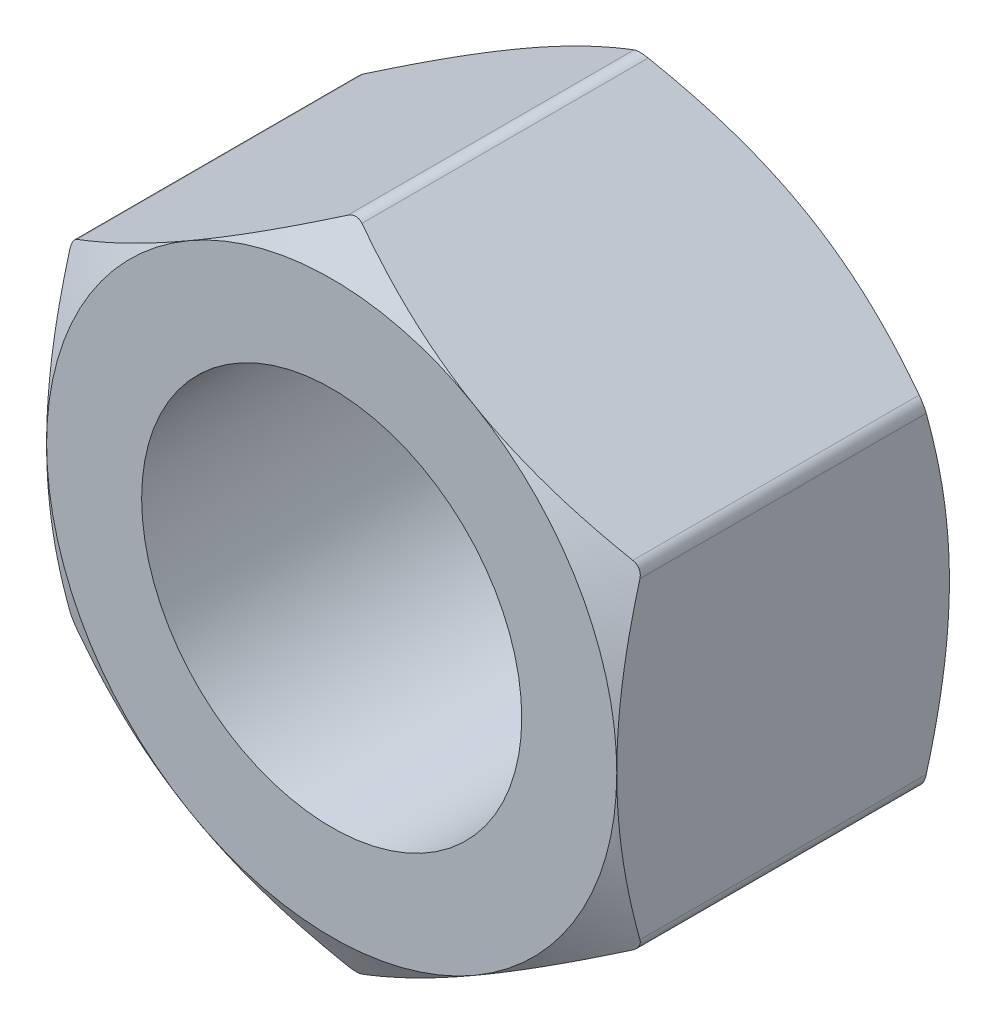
ISO-10303-21;
HEADER;
FILE_DESCRIPTION(('STEP AP214'),'2;1');
FILE_NAME('part.step','',(''),(''),'','','');
FILE_SCHEMA(('AUTOMOTIVE_DESIGN { 1 0 10303 214 1 1 1 1 }'));
ENDSEC;
DATA;
#1=APPLICATION_CONTEXT('core data for automotive mechanical design processes');
#2=APPLICATION_PROTOCOL_DEFINITION('international standard','automotive_design',2000,#1);
#3=PRODUCT_CONTEXT('',#1,'mechanical');
#4=PRODUCT('Part','Part','',(#3));
#5=PRODUCT_RELATED_PRODUCT_CATEGORY('part','',(#4));
#6=PRODUCT_DEFINITION_FORMATION('','',#4);
#7=PRODUCT_DEFINITION_CONTEXT('part definition',#1,'design');
#8=PRODUCT_DEFINITION('design','',#6,#7);
#9=PRODUCT_DEFINITION_SHAPE('','',#8);
#10=(LENGTH_UNIT() NAMED_UNIT(*) SI_UNIT(.MILLI.,.METRE.));
#11=(NAMED_UNIT(*) PLANE_ANGLE_UNIT() SI_UNIT($,.RADIAN.));
#12=(NAMED_UNIT(*) SI_UNIT($,.STERADIAN.) SOLID_ANGLE_UNIT());
#13=UNCERTAINTY_MEASURE_WITH_UNIT(LENGTH_MEASURE(1.E-05),#10,'distance_accuracy_value','');
#14=(GEOMETRIC_REPRESENTATION_CONTEXT(3) GLOBAL_UNCERTAINTY_ASSIGNED_CONTEXT((#13)) GLOBAL_UNIT_ASSIGNED_CONTEXT((#10,
#11,#12)) REPRESENTATION_CONTEXT('',''));
#15=CARTESIAN_POINT('',(0.,0.,0.));
#16=DIRECTION('',(0.,0.,1.));
#17=DIRECTION('',(1.,0.,0.));
#18=AXIS2_PLACEMENT_3D('',#15,#16,#17);
#19=CARTESIAN_POINT('',(0.,0.,-5.55625));
#20=DIRECTION('',(0.,0.,1.));
#21=DIRECTION('',(1.,0.,0.));
#22=AXIS2_PLACEMENT_3D('',#19,#20,#21);
#23=PLANE('',#22);
#24=CARTESIAN_POINT('',(0.,0.,-5.55625));
#25=DIRECTION('',(0.,0.,1.));
#26=DIRECTION('',(1.,0.,0.));
#27=AXIS2_PLACEMENT_3D('',#24,#25,#26);
#28=CIRCLE('',#27,6.35);
#29=CARTESIAN_POINT('',(6.35,0.,-5.55625));
#30=VERTEX_POINT('',#29);
#31=EDGE_CURVE('E736',#30,#30,#28,.T.);
#32=ORIENTED_EDGE('',*,*,#31,.T.);
#33=EDGE_LOOP('',(#32));
#34=FACE_BOUND('',#33,.T.);
#35=CARTESIAN_POINT('',(0.,0.,-5.55625));
#36=DIRECTION('',(0.,0.,1.));
#37=DIRECTION('',(1.,0.,0.));
#38=AXIS2_PLACEMENT_3D('',#35,#36,#37);
#39=CIRCLE('',#38,9.525);
#40=CARTESIAN_POINT('',(9.525,0.,-5.55625));
#41=VERTEX_POINT('',#40);
#42=CARTESIAN_POINT('',(4.76250000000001,8.24889197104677,-5.55625));
#43=VERTEX_POINT('',#42);
#44=EDGE_CURVE('E203',#41,#43,#39,.T.);
#45=ORIENTED_EDGE('',*,*,#44,.F.);
#46=CARTESIAN_POINT('',(0.,0.,-5.55625));
#47=DIRECTION('',(0.,0.,1.));
#48=DIRECTION('',(1.,0.,0.));
#49=AXIS2_PLACEMENT_3D('',#46,#47,#48);
#50=CIRCLE('',#49,9.525);
#51=CARTESIAN_POINT('',(4.7625,-8.24889197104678,-5.55625));
#52=VERTEX_POINT('',#51);
#53=EDGE_CURVE('E219',#41,#52,#50,.F.);
#54=ORIENTED_EDGE('',*,*,#53,.T.);
#55=CARTESIAN_POINT('',(-4.76250000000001,-8.24889197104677,-5.55625));
#56=VERTEX_POINT('',#55);
#57=EDGE_CURVE('E228',#52,#56,#50,.F.);
#58=ORIENTED_EDGE('',*,*,#57,.T.);
#59=CARTESIAN_POINT('',(-9.525,0.,-5.55625));
#60=VERTEX_POINT('',#59);
#61=EDGE_CURVE('E222',#56,#60,#50,.F.);
#62=ORIENTED_EDGE('',*,*,#61,.T.);
#63=CARTESIAN_POINT('',(-4.76249999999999,8.24889197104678,-5.55625));
#64=VERTEX_POINT('',#63);
#65=EDGE_CURVE('E213',#60,#64,#50,.F.);
#66=ORIENTED_EDGE('',*,*,#65,.T.);
#67=EDGE_CURVE('E198',#64,#43,#50,.F.);
#68=ORIENTED_EDGE('',*,*,#67,.T.);
#69=EDGE_LOOP('',(#45,#54,#58,#62,#66,#68));
#70=FACE_BOUND('',#69,.T.);
#71=ADVANCED_FACE('F47',(#34,#70),#23,.F.);
#72=CARTESIAN_POINT('',(9.525,5.49926131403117,5.55625));
#73=DIRECTION('',(-0.500000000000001,-0.866025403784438,0.));
#74=DIRECTION('',(0.866025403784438,-0.500000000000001,0.));
#75=AXIS2_PLACEMENT_3D('',#72,#73,#74);
#76=PLANE('',#75);
#77=CARTESIAN_POINT('',(9.5252,5.49914584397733,4.70544464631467));
#78=CARTESIAN_POINT('',(9.31581967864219,5.62003162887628,4.77522679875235));
#79=CARTESIAN_POINT('',(9.10565867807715,5.74136813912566,4.84184176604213));
#80=CARTESIAN_POINT('',(8.68365134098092,5.98501418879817,4.96785853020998));
#81=CARTESIAN_POINT('',(8.47180447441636,6.10732403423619,5.02725795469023));
#82=CARTESIAN_POINT('',(7.83285037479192,6.47622435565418,5.19348339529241));
#83=CARTESIAN_POINT('',(7.40322078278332,6.72427111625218,5.28803167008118));
#84=CARTESIAN_POINT('',(6.76029976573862,7.0954617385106,5.39889837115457));
#85=CARTESIAN_POINT('',(6.54892911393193,7.21749664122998,5.43048013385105));
#86=CARTESIAN_POINT('',(6.12520917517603,7.46213146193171,5.4834407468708));
#87=CARTESIAN_POINT('',(5.91285986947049,7.58473139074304,5.50481940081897));
#88=CARTESIAN_POINT('',(5.48780704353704,7.83013575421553,5.53682602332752));
#89=CARTESIAN_POINT('',(5.27510424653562,7.95293977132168,5.5474667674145));
#90=CARTESIAN_POINT('',(4.84950217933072,8.19866123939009,5.55777146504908));
#91=CARTESIAN_POINT('',(4.63660291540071,8.32157868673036,5.55743575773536));
#92=CARTESIAN_POINT('',(4.23858252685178,8.55137586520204,5.54655115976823));
#93=CARTESIAN_POINT('',(4.05343331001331,8.65827181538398,5.53733005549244));
#94=CARTESIAN_POINT('',(3.68356790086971,8.87181370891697,5.51076519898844));
#95=CARTESIAN_POINT('',(3.49885174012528,8.97845963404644,5.49342087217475));
#96=CARTESIAN_POINT('',(2.94541899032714,9.29798418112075,5.42961312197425));
#97=CARTESIAN_POINT('',(2.57768201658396,9.51029722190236,5.37138287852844));
#98=CARTESIAN_POINT('',(1.83830726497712,9.93717543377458,5.22580670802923));
#99=CARTESIAN_POINT('',(1.46676384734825,10.1516861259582,5.13784370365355));
#100=CARTESIAN_POINT('',(0.72921761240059,10.5775086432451,4.93820420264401));
#101=CARTESIAN_POINT('',(0.363205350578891,10.7888259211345,4.82657459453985));
#102=CARTESIAN_POINT('',(-0.000199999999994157,10.9986380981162,4.70544464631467));
#103=B_SPLINE_CURVE_WITH_KNOTS('',3,(#77,#78,#79,#80,#81,#82,#83,#84,#85,#86,#87,#88,#89,#90,
#91,#92,#93,#94,#95,#96,#97,#98,#99,#100,#101,#102),.UNSPECIFIED.,.F.,.F.,(4,2,2,2,2,2,2,2,2,2,
2,2,4),(0.,0.754861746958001,1.50997101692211,3.02340406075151,3.76154608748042,
4.49970232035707,5.23697928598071,5.97423347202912,6.61604550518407,7.25790294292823,
8.54252993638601,9.85564695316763,11.1661863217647),.UNSPECIFIED.);
#104=CARTESIAN_POINT('',(9.28687500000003,5.63674284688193,4.78337937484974));
#105=VERTEX_POINT('',#104);
#106=CARTESIAN_POINT('',(4.76250000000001,8.24889197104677,5.55625));
#107=VERTEX_POINT('',#106);
#108=EDGE_CURVE('E472',#105,#107,#103,.T.);
#109=ORIENTED_EDGE('',*,*,#108,.F.);
#110=DIRECTION('',(0.,0.,-1.));
#111=VECTOR('',#110,1.);
#112=CARTESIAN_POINT('',(9.286875,5.63674284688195,5.55625));
#113=LINE('',#112,#111);
#114=CARTESIAN_POINT('',(9.28687500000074,5.63674284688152,-4.78337937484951));
#115=VERTEX_POINT('',#114);
#116=EDGE_CURVE('E190',#105,#115,#113,.T.);
#117=ORIENTED_EDGE('',*,*,#116,.T.);
#118=CARTESIAN_POINT('',(9.5252,5.49914584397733,-4.70544464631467));
#119=CARTESIAN_POINT('',(9.31581967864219,5.62003162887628,-4.77522679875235));
#120=CARTESIAN_POINT('',(9.10565867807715,5.74136813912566,-4.84184176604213));
#121=CARTESIAN_POINT('',(8.68365134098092,5.98501418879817,-4.96785853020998));
#122=CARTESIAN_POINT('',(8.47180447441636,6.10732403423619,-5.02725795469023));
#123=CARTESIAN_POINT('',(7.83285037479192,6.47622435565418,-5.19348339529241));
#124=CARTESIAN_POINT('',(7.40322078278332,6.72427111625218,-5.28803167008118));
#125=CARTESIAN_POINT('',(6.76029976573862,7.0954617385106,-5.39889837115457));
#126=CARTESIAN_POINT('',(6.54892911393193,7.21749664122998,-5.43048013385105));
#127=CARTESIAN_POINT('',(6.12520917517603,7.46213146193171,-5.4834407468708));
#128=CARTESIAN_POINT('',(5.91285986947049,7.58473139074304,-5.50481940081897));
#129=CARTESIAN_POINT('',(5.48780704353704,7.83013575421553,-5.53682602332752));
#130=CARTESIAN_POINT('',(5.27510424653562,7.95293977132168,-5.5474667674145));
#131=CARTESIAN_POINT('',(4.84950217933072,8.19866123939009,-5.55777146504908));
#132=CARTESIAN_POINT('',(4.63660291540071,8.32157868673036,-5.55743575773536));
#133=CARTESIAN_POINT('',(4.23858252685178,8.55137586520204,-5.54655115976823));
#134=CARTESIAN_POINT('',(4.05343331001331,8.65827181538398,-5.53733005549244));
#135=CARTESIAN_POINT('',(3.68356790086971,8.87181370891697,-5.51076519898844));
#136=CARTESIAN_POINT('',(3.49885174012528,8.97845963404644,-5.49342087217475));
#137=CARTESIAN_POINT('',(2.94541899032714,9.29798418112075,-5.42961312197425));
#138=CARTESIAN_POINT('',(2.57768201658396,9.51029722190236,-5.37138287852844));
#139=CARTESIAN_POINT('',(1.83830726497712,9.93717543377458,-5.22580670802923));
#140=CARTESIAN_POINT('',(1.46676384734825,10.1516861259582,-5.13784370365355));
#141=CARTESIAN_POINT('',(0.72921761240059,10.5775086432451,-4.93820420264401));
#142=CARTESIAN_POINT('',(0.363205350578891,10.7888259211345,-4.82657459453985));
#143=CARTESIAN_POINT('',(-0.000199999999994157,10.9986380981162,-4.70544464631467));
#144=B_SPLINE_CURVE_WITH_KNOTS('',3,(#118,#119,#120,#121,#122,#123,#124,#125,#126,#127,#128,
#129,#130,#131,#132,#133,#134,#135,#136,#137,#138,#139,#140,#141,#142,#143),.UNSPECIFIED.,.F.,
.F.,(4,2,2,2,2,2,2,2,2,2,2,2,4),(0.,0.754861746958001,1.50997101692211,3.02340406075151,
3.76154608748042,4.49970232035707,5.23697928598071,5.97423347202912,6.61604550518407,
7.25790294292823,8.54252993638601,9.85564695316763,11.1661863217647),.UNSPECIFIED.);
#145=EDGE_CURVE('E182',#115,#43,#144,.T.);
#146=ORIENTED_EDGE('',*,*,#145,.T.);
#147=CARTESIAN_POINT('',(0.238125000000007,10.8610410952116,-4.78337937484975));
#148=VERTEX_POINT('',#147);
#149=EDGE_CURVE('E184',#43,#148,#144,.T.);
#150=ORIENTED_EDGE('',*,*,#149,.T.);
#151=DIRECTION('',(0.,0.,-1.));
#152=VECTOR('',#151,1.);
#153=CARTESIAN_POINT('',(0.238125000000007,10.8610410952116,5.55625));
#154=LINE('',#153,#152);
#155=CARTESIAN_POINT('',(0.238125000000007,10.8610410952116,4.78337937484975));
#156=VERTEX_POINT('',#155);
#157=EDGE_CURVE('E78',#148,#156,#154,.F.);
#158=ORIENTED_EDGE('',*,*,#157,.T.);
#159=EDGE_CURVE('E455',#107,#156,#103,.T.);
#160=ORIENTED_EDGE('',*,*,#159,.F.);
#161=EDGE_LOOP('',(#109,#117,#146,#150,#158,#160));
#162=FACE_BOUND('',#161,.T.);
#163=ADVANCED_FACE('F185',(#162),#76,.F.);
#164=CARTESIAN_POINT('',(0.,10.9985226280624,5.55625));
#165=DIRECTION('',(0.499999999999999,-0.866025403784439,0.));
#166=DIRECTION('',(0.866025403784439,0.499999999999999,0.));
#167=AXIS2_PLACEMENT_3D('',#164,#165,#166);
#168=PLANE('',#167);
#169=CARTESIAN_POINT('',(0.00020000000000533,10.9986380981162,-4.70544464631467));
#170=CARTESIAN_POINT('',(-0.20918032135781,10.8777523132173,-4.77522679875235));
#171=CARTESIAN_POINT('',(-0.419341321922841,10.7564158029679,-4.84184176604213));
#172=CARTESIAN_POINT('',(-0.841348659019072,10.5127697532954,-4.96785853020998));
#173=CARTESIAN_POINT('',(-1.05319552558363,10.3904599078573,-5.02725795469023));
#174=CARTESIAN_POINT('',(-1.69214962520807,10.0215595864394,-5.19348339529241));
#175=CARTESIAN_POINT('',(-2.12177921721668,9.77351282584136,-5.28803167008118));
#176=CARTESIAN_POINT('',(-2.76470023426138,9.40232220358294,-5.39889837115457));
#177=CARTESIAN_POINT('',(-2.97607088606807,9.28028730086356,-5.43048013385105));
#178=CARTESIAN_POINT('',(-3.39979082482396,9.03565248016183,-5.4834407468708));
#179=CARTESIAN_POINT('',(-3.61214013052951,8.9130525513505,-5.50481940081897));
#180=CARTESIAN_POINT('',(-4.03719295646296,8.66764818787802,-5.53682602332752));
#181=CARTESIAN_POINT('',(-4.24989575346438,8.54484417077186,-5.5474667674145));
#182=CARTESIAN_POINT('',(-4.67549782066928,8.29912270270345,-5.55777146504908));
#183=CARTESIAN_POINT('',(-4.88839708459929,8.17620525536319,-5.55743575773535));
#184=CARTESIAN_POINT('',(-5.28641747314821,7.9464080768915,-5.54655115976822));
#185=CARTESIAN_POINT('',(-5.47156668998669,7.83951212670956,-5.53733005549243));
#186=CARTESIAN_POINT('',(-5.84143209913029,7.62597023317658,-5.51076519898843));
#187=CARTESIAN_POINT('',(-6.02614825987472,7.5193243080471,-5.49342087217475));
#188=CARTESIAN_POINT('',(-6.57958100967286,7.19979976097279,-5.42961312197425));
#189=CARTESIAN_POINT('',(-6.94731798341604,6.98748672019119,-5.37138287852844));
#190=CARTESIAN_POINT('',(-7.68669273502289,6.56060850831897,-5.22580670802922));
#191=CARTESIAN_POINT('',(-8.05823615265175,6.34609781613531,-5.13784370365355));
#192=CARTESIAN_POINT('',(-8.79578238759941,5.92027529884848,-4.93820420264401));
#193=CARTESIAN_POINT('',(-9.16179464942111,5.70895802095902,-4.82657459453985));
#194=CARTESIAN_POINT('',(-9.5252,5.49914584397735,-4.70544464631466));
#195=B_SPLINE_CURVE_WITH_KNOTS('',3,(#169,#170,#171,#172,#173,#174,#175,#176,#177,#178,#179,
#180,#181,#182,#183,#184,#185,#186,#187,#188,#189,#190,#191,#192,#193,#194),.UNSPECIFIED.,.F.,
.F.,(4,2,2,2,2,2,2,2,2,2,2,2,4),(0.,0.754861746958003,1.50997101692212,3.02340406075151,
3.76154608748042,4.49970232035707,5.23697928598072,5.97423347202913,6.61604550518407,
7.25790294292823,8.54252993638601,9.85564695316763,11.1661863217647),.UNSPECIFIED.);
#196=CARTESIAN_POINT('',(-9.286875,5.63674284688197,-4.78337937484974));
#197=VERTEX_POINT('',#196);
#198=EDGE_CURVE('E258',#64,#197,#195,.T.);
#199=ORIENTED_EDGE('',*,*,#198,.T.);
#200=DIRECTION('',(0.,0.,-1.));
#201=VECTOR('',#200,1.);
#202=CARTESIAN_POINT('',(-9.286875,5.63674284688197,5.55625));
#203=LINE('',#202,#201);
#204=CARTESIAN_POINT('',(-9.286875,5.63674284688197,4.78337937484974));
#205=VERTEX_POINT('',#204);
#206=EDGE_CURVE('E425',#197,#205,#203,.F.);
#207=ORIENTED_EDGE('',*,*,#206,.T.);
#208=CARTESIAN_POINT('',(0.00020000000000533,10.9986380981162,4.70544464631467));
#209=CARTESIAN_POINT('',(-0.20918032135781,10.8777523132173,4.77522679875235));
#210=CARTESIAN_POINT('',(-0.419341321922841,10.7564158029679,4.84184176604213));
#211=CARTESIAN_POINT('',(-0.841348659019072,10.5127697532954,4.96785853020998));
#212=CARTESIAN_POINT('',(-1.05319552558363,10.3904599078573,5.02725795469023));
#213=CARTESIAN_POINT('',(-1.69214962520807,10.0215595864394,5.19348339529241));
#214=CARTESIAN_POINT('',(-2.12177921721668,9.77351282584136,5.28803167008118));
#215=CARTESIAN_POINT('',(-2.76470023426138,9.40232220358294,5.39889837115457));
#216=CARTESIAN_POINT('',(-2.97607088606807,9.28028730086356,5.43048013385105));
#217=CARTESIAN_POINT('',(-3.39979082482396,9.03565248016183,5.4834407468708));
#218=CARTESIAN_POINT('',(-3.61214013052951,8.9130525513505,5.50481940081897));
#219=CARTESIAN_POINT('',(-4.03719295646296,8.66764818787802,5.53682602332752));
#220=CARTESIAN_POINT('',(-4.24989575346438,8.54484417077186,5.5474667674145));
#221=CARTESIAN_POINT('',(-4.67549782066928,8.29912270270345,5.55777146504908));
#222=CARTESIAN_POINT('',(-4.88839708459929,8.17620525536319,5.55743575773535));
#223=CARTESIAN_POINT('',(-5.28641747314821,7.9464080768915,5.54655115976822));
#224=CARTESIAN_POINT('',(-5.47156668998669,7.83951212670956,5.53733005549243));
#225=CARTESIAN_POINT('',(-5.84143209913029,7.62597023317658,5.51076519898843));
#226=CARTESIAN_POINT('',(-6.02614825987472,7.5193243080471,5.49342087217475));
#227=CARTESIAN_POINT('',(-6.57958100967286,7.19979976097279,5.42961312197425));
#228=CARTESIAN_POINT('',(-6.94731798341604,6.98748672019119,5.37138287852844));
#229=CARTESIAN_POINT('',(-7.68669273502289,6.56060850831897,5.22580670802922));
#230=CARTESIAN_POINT('',(-8.05823615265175,6.34609781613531,5.13784370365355));
#231=CARTESIAN_POINT('',(-8.79578238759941,5.92027529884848,4.93820420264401));
#232=CARTESIAN_POINT('',(-9.16179464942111,5.70895802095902,4.82657459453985));
#233=CARTESIAN_POINT('',(-9.5252,5.49914584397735,4.70544464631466));
#234=B_SPLINE_CURVE_WITH_KNOTS('',3,(#208,#209,#210,#211,#212,#213,#214,#215,#216,#217,#218,
#219,#220,#221,#222,#223,#224,#225,#226,#227,#228,#229,#230,#231,#232,#233),.UNSPECIFIED.,.F.,
.F.,(4,2,2,2,2,2,2,2,2,2,2,2,4),(0.,0.754861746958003,1.50997101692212,3.02340406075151,
3.76154608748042,4.49970232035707,5.23697928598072,5.97423347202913,6.61604550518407,
7.25790294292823,8.54252993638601,9.85564695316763,11.1661863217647),.UNSPECIFIED.);
#235=CARTESIAN_POINT('',(-4.76249999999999,8.24889197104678,5.55625));
#236=VERTEX_POINT('',#235);
#237=EDGE_CURVE('E445',#236,#205,#234,.T.);
#238=ORIENTED_EDGE('',*,*,#237,.F.);
#239=CARTESIAN_POINT('',(-0.238124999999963,10.8610410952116,4.78337937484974));
#240=VERTEX_POINT('',#239);
#241=EDGE_CURVE('E448',#240,#236,#234,.T.);
#242=ORIENTED_EDGE('',*,*,#241,.F.);
#243=DIRECTION('',(0.,0.,-1.));
#244=VECTOR('',#243,1.);
#245=CARTESIAN_POINT('',(-0.238124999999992,10.8610410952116,5.55625));
#246=LINE('',#245,#244);
#247=CARTESIAN_POINT('',(-0.23812499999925,10.861041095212,-4.78337937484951));
#248=VERTEX_POINT('',#247);
#249=EDGE_CURVE('E424',#240,#248,#246,.T.);
#250=ORIENTED_EDGE('',*,*,#249,.T.);
#251=EDGE_CURVE('E201',#248,#64,#195,.T.);
#252=ORIENTED_EDGE('',*,*,#251,.T.);
#253=EDGE_LOOP('',(#199,#207,#238,#242,#250,#252));
#254=FACE_BOUND('',#253,.T.);
#255=ADVANCED_FACE('F285',(#254),#168,.F.);
#256=CARTESIAN_POINT('',(-9.525,5.49926131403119,5.55625));
#257=DIRECTION('',(1.,0.,0.));
#258=DIRECTION('',(0.,1.,0.));
#259=AXIS2_PLACEMENT_3D('',#256,#257,#258);
#260=PLANE('',#259);
#261=CARTESIAN_POINT('',(-9.52500000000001,-14.8125411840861,0.887964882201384));
#262=CARTESIAN_POINT('',(-9.52500000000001,-14.6043029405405,0.989086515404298));
#263=CARTESIAN_POINT('',(-9.52500000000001,-14.3958213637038,1.08970682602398));
#264=CARTESIAN_POINT('',(-9.52500000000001,-13.9783207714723,1.28983130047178));
#265=CARTESIAN_POINT('',(-9.52500000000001,-13.769301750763,1.38933545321));
#266=CARTESIAN_POINT('',(-9.52500000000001,-13.1413071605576,1.68602943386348));
#267=CARTESIAN_POINT('',(-9.52500000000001,-12.7214551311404,1.88137104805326));
#268=CARTESIAN_POINT('',(-9.52500000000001,-11.8766898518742,2.2669936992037));
#269=CARTESIAN_POINT('',(-9.52500000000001,-11.4517615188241,2.45724177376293));
#270=CARTESIAN_POINT('',(-9.52500000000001,-10.5985386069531,2.83000565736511));
#271=CARTESIAN_POINT('',(-9.52500000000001,-10.1702441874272,3.01252182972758));
#272=CARTESIAN_POINT('',(-9.52500000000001,-9.29589115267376,3.37343769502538));
#273=CARTESIAN_POINT('',(-9.52500000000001,-8.849701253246,3.55152107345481));
#274=CARTESIAN_POINT('',(-9.52500000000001,-7.95211843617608,3.89430869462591));
#275=CARTESIAN_POINT('',(-9.52500000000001,-7.50072494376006,4.05901144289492));
#276=CARTESIAN_POINT('',(-9.52500000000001,-6.59284163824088,4.37074518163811));
#277=CARTESIAN_POINT('',(-9.52500000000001,-6.13636409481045,4.51781152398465));
#278=CARTESIAN_POINT('',(-9.52500000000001,-5.21687909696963,4.78958361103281));
#279=CARTESIAN_POINT('',(-9.52500000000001,-4.75387373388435,4.91429634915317));
#280=CARTESIAN_POINT('',(-9.52500000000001,-3.82343506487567,5.134765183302));
#281=CARTESIAN_POINT('',(-9.525,-3.35603838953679,5.23067170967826));
#282=CARTESIAN_POINT('',(-9.525,-2.65065613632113,5.34876475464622));
#283=CARTESIAN_POINT('',(-9.525,-2.41479798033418,5.38383615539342));
#284=CARTESIAN_POINT('',(-9.525,-1.94189547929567,5.44470332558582));
#285=CARTESIAN_POINT('',(-9.525,-1.70485125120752,5.47049999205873));
#286=CARTESIAN_POINT('',(-9.525,-1.23300996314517,5.51197797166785));
#287=CARTESIAN_POINT('',(-9.525,-0.998224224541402,5.52778755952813));
#288=CARTESIAN_POINT('',(-9.525,-0.528194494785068,5.5494618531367));
#289=CARTESIAN_POINT('',(-9.525,-0.292950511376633,5.55532672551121));
#290=CARTESIAN_POINT('',(-9.525,0.177578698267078,5.55697157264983));
#291=CARTESIAN_POINT('',(-9.525,0.412863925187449,5.55275136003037));
#292=CARTESIAN_POINT('',(-9.525,0.88304622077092,5.53432939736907));
#293=CARTESIAN_POINT('',(-9.525,1.11794326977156,5.52012715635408));
#294=CARTESIAN_POINT('',(-9.525,1.68102212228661,5.47441971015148));
#295=CARTESIAN_POINT('',(-9.525,2.00883411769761,5.43825942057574));
#296=CARTESIAN_POINT('',(-9.525,2.66203829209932,5.34845971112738));
#297=CARTESIAN_POINT('',(-9.525,2.98743014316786,5.29481796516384));
#298=CARTESIAN_POINT('',(-9.525,3.95957625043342,5.11051454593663));
#299=CARTESIAN_POINT('',(-9.525,4.60196350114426,4.95650572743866));
#300=CARTESIAN_POINT('',(-9.525,5.56298873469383,4.68916503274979));
#301=CARTESIAN_POINT('',(-9.525,5.88659719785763,4.59267300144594));
#302=CARTESIAN_POINT('',(-9.525,6.53066921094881,4.38961517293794));
#303=CARTESIAN_POINT('',(-9.525,6.85113273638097,4.28304929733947));
#304=CARTESIAN_POINT('',(-9.525,7.48902180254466,4.06155849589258));
#305=CARTESIAN_POINT('',(-9.525,7.80644823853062,3.94663612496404));
#306=CARTESIAN_POINT('',(-9.525,8.43866078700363,3.70979014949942));
#307=CARTESIAN_POINT('',(-9.525,8.7534469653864,3.58786672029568));
#308=CARTESIAN_POINT('',(-9.525,9.62795641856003,3.23976678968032));
#309=CARTESIAN_POINT('',(-9.525,10.1851264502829,3.00718116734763));
#310=CARTESIAN_POINT('',(-9.525,11.2935993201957,2.52837604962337));
#311=CARTESIAN_POINT('',(-9.52499999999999,11.844901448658,2.28215492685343));
#312=CARTESIAN_POINT('',(-9.52499999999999,12.9430576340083,1.77944097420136));
#313=CARTESIAN_POINT('',(-9.52499999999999,13.4899097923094,1.52294401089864));
#314=CARTESIAN_POINT('',(-9.52499999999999,14.5798853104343,1.00223426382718));
#315=CARTESIAN_POINT('',(-9.52499999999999,15.1230088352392,0.738021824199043));
#316=CARTESIAN_POINT('',(-9.52499999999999,16.2071964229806,0.203177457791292));
#317=CARTESIAN_POINT('',(-9.52499999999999,16.7482555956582,-0.0674643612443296));
#318=CARTESIAN_POINT('',(-9.52499999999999,17.8279905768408,-0.613465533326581));
#319=CARTESIAN_POINT('',(-9.52499999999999,18.3666663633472,-0.888824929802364));
#320=CARTESIAN_POINT('',(-9.52499999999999,19.441949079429,-1.44324213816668));
#321=CARTESIAN_POINT('',(-9.52499999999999,19.9785564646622,-1.72229906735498));
#322=CARTESIAN_POINT('',(-9.52499999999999,21.0501749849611,-2.2834628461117));
#323=CARTESIAN_POINT('',(-9.52499999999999,21.585186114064,-2.56556970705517));
#324=CARTESIAN_POINT('',(-9.52499999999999,23.0698992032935,-3.35286570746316));
#325=CARTESIAN_POINT('',(-9.52499999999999,24.0181751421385,-3.86074347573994));
#326=CARTESIAN_POINT('',(-9.52499999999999,25.9117351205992,-4.88218253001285));
#327=CARTESIAN_POINT('',(-9.52499999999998,26.8570189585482,-5.3957441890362));
#328=CARTESIAN_POINT('',(-9.52499999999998,28.7421050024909,-6.42534719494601));
#329=CARTESIAN_POINT('',(-9.52499999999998,29.6819149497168,-6.94137437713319));
#330=CARTESIAN_POINT('',(-9.52499999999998,31.0902671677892,-7.7177943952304));
#331=CARTESIAN_POINT('',(-9.52499999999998,31.5594718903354,-7.97698710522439));
#332=CARTESIAN_POINT('',(-9.52499999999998,32.4974876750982,-8.49608270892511));
#333=CARTESIAN_POINT('',(-9.52499999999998,32.9662987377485,-8.75598560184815));
#334=CARTESIAN_POINT('',(-9.52499999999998,33.4349374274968,-9.01619900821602));
#335=B_SPLINE_CURVE_WITH_KNOTS('',3,(#261,#262,#263,#264,#265,#266,#267,#268,#269,#270,#271,
#272,#273,#274,#275,#276,#277,#278,#279,#280,#281,#282,#283,#284,#285,#286,#287,#288,#289,#290,
#291,#292,#293,#294,#295,#296,#297,#298,#299,#300,#301,#302,#303,#304,#305,#306,#307,#308,#309,
#310,#311,#312,#313,#314,#315,#316,#317,#318,#319,#320,#321,#322,#323,#324,#325,#326,#327,#328,
#329,#330,#331,#332,#333,#334),.UNSPECIFIED.,.F.,.F.,(4,2,2,2,2,2,2,2,2,2,2,2,2,2,2,2,2,2,2,2,2,
2,2,2,2,2,2,2,2,2,2,2,2,2,2,2,4),(0.,0.694476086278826,1.38895906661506,2.77812878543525,
4.17478822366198,5.57138196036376,7.0124621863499,8.45370314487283,9.89200508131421,
11.3298562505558,12.7600626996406,13.4752632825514,14.190394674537,14.896143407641,
15.6018803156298,16.3076303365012,17.0134150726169,18.0022589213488,18.9912343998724,
20.9701977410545,21.9831758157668,22.996161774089,24.0088393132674,25.0214915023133,
26.8325129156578,28.6437509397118,30.4557249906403,32.2676183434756,34.0825076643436,
35.8974137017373,37.7118940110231,39.5263810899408,42.7535018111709,45.9808355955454,
49.1973064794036,50.8054121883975,52.413516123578),.UNSPECIFIED.);
#336=CARTESIAN_POINT('',(-9.525,5.22429824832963,4.78337937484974));
#337=VERTEX_POINT('',#336);
#338=CARTESIAN_POINT('',(-9.525,0.,5.55625));
#339=VERTEX_POINT('',#338);
#340=EDGE_CURVE('E433',#337,#339,#335,.F.);
#341=ORIENTED_EDGE('',*,*,#340,.F.);
#342=DIRECTION('',(0.,0.,-1.));
#343=VECTOR('',#342,1.);
#344=CARTESIAN_POINT('',(-9.525,5.22429824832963,5.55625));
#345=LINE('',#344,#343);
#346=CARTESIAN_POINT('',(-9.525,5.22429824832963,-4.78337937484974));
#347=VERTEX_POINT('',#346);
#348=EDGE_CURVE('E234',#337,#347,#345,.T.);
#349=ORIENTED_EDGE('',*,*,#348,.T.);
#350=CARTESIAN_POINT('',(-9.52500000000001,-14.8125411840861,-0.887964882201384));
#351=CARTESIAN_POINT('',(-9.52500000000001,-14.6043029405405,-0.989086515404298));
#352=CARTESIAN_POINT('',(-9.52500000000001,-14.3958213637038,-1.08970682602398));
#353=CARTESIAN_POINT('',(-9.52500000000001,-13.9783207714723,-1.28983130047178));
#354=CARTESIAN_POINT('',(-9.52500000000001,-13.769301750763,-1.38933545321));
#355=CARTESIAN_POINT('',(-9.52500000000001,-13.1413071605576,-1.68602943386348));
#356=CARTESIAN_POINT('',(-9.52500000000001,-12.7214551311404,-1.88137104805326));
#357=CARTESIAN_POINT('',(-9.52500000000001,-11.8766898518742,-2.2669936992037));
#358=CARTESIAN_POINT('',(-9.52500000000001,-11.4517615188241,-2.45724177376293));
#359=CARTESIAN_POINT('',(-9.52500000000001,-10.5985386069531,-2.83000565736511));
#360=CARTESIAN_POINT('',(-9.52500000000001,-10.1702441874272,-3.01252182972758));
#361=CARTESIAN_POINT('',(-9.52500000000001,-9.29589115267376,-3.37343769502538));
#362=CARTESIAN_POINT('',(-9.52500000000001,-8.849701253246,-3.55152107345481));
#363=CARTESIAN_POINT('',(-9.52500000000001,-7.95211843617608,-3.89430869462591));
#364=CARTESIAN_POINT('',(-9.52500000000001,-7.50072494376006,-4.05901144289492));
#365=CARTESIAN_POINT('',(-9.52500000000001,-6.59284163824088,-4.37074518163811));
#366=CARTESIAN_POINT('',(-9.52500000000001,-6.13636409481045,-4.51781152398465));
#367=CARTESIAN_POINT('',(-9.52500000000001,-5.21687909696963,-4.78958361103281));
#368=CARTESIAN_POINT('',(-9.52500000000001,-4.75387373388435,-4.91429634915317));
#369=CARTESIAN_POINT('',(-9.52500000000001,-3.82343506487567,-5.134765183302));
#370=CARTESIAN_POINT('',(-9.525,-3.35603838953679,-5.23067170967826));
#371=CARTESIAN_POINT('',(-9.525,-2.65065613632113,-5.34876475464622));
#372=CARTESIAN_POINT('',(-9.525,-2.41479798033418,-5.38383615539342));
#373=CARTESIAN_POINT('',(-9.525,-1.94189547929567,-5.44470332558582));
#374=CARTESIAN_POINT('',(-9.525,-1.70485125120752,-5.47049999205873));
#375=CARTESIAN_POINT('',(-9.525,-1.23300996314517,-5.51197797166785));
#376=CARTESIAN_POINT('',(-9.525,-0.998224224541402,-5.52778755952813));
#377=CARTESIAN_POINT('',(-9.525,-0.528194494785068,-5.5494618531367));
#378=CARTESIAN_POINT('',(-9.525,-0.292950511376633,-5.55532672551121));
#379=CARTESIAN_POINT('',(-9.525,0.177578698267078,-5.55697157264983));
#380=CARTESIAN_POINT('',(-9.525,0.412863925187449,-5.55275136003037));
#381=CARTESIAN_POINT('',(-9.525,0.88304622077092,-5.53432939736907));
#382=CARTESIAN_POINT('',(-9.525,1.11794326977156,-5.52012715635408));
#383=CARTESIAN_POINT('',(-9.525,1.68102212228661,-5.47441971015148));
#384=CARTESIAN_POINT('',(-9.525,2.00883411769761,-5.43825942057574));
#385=CARTESIAN_POINT('',(-9.525,2.66203829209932,-5.34845971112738));
#386=CARTESIAN_POINT('',(-9.525,2.98743014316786,-5.29481796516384));
#387=CARTESIAN_POINT('',(-9.525,3.95957625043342,-5.11051454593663));
#388=CARTESIAN_POINT('',(-9.525,4.60196350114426,-4.95650572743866));
#389=CARTESIAN_POINT('',(-9.525,5.56298873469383,-4.68916503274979));
#390=CARTESIAN_POINT('',(-9.525,5.88659719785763,-4.59267300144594));
#391=CARTESIAN_POINT('',(-9.525,6.53066921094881,-4.38961517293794));
#392=CARTESIAN_POINT('',(-9.525,6.85113273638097,-4.28304929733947));
#393=CARTESIAN_POINT('',(-9.525,7.48902180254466,-4.06155849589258));
#394=CARTESIAN_POINT('',(-9.525,7.80644823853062,-3.94663612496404));
#395=CARTESIAN_POINT('',(-9.525,8.43866078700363,-3.70979014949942));
#396=CARTESIAN_POINT('',(-9.525,8.7534469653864,-3.58786672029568));
#397=CARTESIAN_POINT('',(-9.525,9.62795641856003,-3.23976678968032));
#398=CARTESIAN_POINT('',(-9.525,10.1851264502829,-3.00718116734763));
#399=CARTESIAN_POINT('',(-9.525,11.2935993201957,-2.52837604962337));
#400=CARTESIAN_POINT('',(-9.52499999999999,11.844901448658,-2.28215492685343));
#401=CARTESIAN_POINT('',(-9.52499999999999,12.9430576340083,-1.77944097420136));
#402=CARTESIAN_POINT('',(-9.52499999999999,13.4899097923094,-1.52294401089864));
#403=CARTESIAN_POINT('',(-9.52499999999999,14.5798853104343,-1.00223426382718));
#404=CARTESIAN_POINT('',(-9.52499999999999,15.1230088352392,-0.738021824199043));
#405=CARTESIAN_POINT('',(-9.52499999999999,16.2071964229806,-0.203177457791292));
#406=CARTESIAN_POINT('',(-9.52499999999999,16.7482555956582,0.0674643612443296));
#407=CARTESIAN_POINT('',(-9.52499999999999,17.8279905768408,0.613465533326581));
#408=CARTESIAN_POINT('',(-9.52499999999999,18.3666663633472,0.888824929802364));
#409=CARTESIAN_POINT('',(-9.52499999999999,19.441949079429,1.44324213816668));
#410=CARTESIAN_POINT('',(-9.52499999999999,19.9785564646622,1.72229906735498));
#411=CARTESIAN_POINT('',(-9.52499999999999,21.0501749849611,2.2834628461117));
#412=CARTESIAN_POINT('',(-9.52499999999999,21.585186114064,2.56556970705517));
#413=CARTESIAN_POINT('',(-9.52499999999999,23.0698992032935,3.35286570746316));
#414=CARTESIAN_POINT('',(-9.52499999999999,24.0181751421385,3.86074347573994));
#415=CARTESIAN_POINT('',(-9.52499999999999,25.9117351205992,4.88218253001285));
#416=CARTESIAN_POINT('',(-9.52499999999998,26.8570189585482,5.3957441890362));
#417=CARTESIAN_POINT('',(-9.52499999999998,28.7421050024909,6.42534719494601));
#418=CARTESIAN_POINT('',(-9.52499999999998,29.6819149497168,6.94137437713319));
#419=CARTESIAN_POINT('',(-9.52499999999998,31.0902671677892,7.7177943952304));
#420=CARTESIAN_POINT('',(-9.52499999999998,31.5594718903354,7.97698710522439));
#421=CARTESIAN_POINT('',(-9.52499999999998,32.4974876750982,8.49608270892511));
#422=CARTESIAN_POINT('',(-9.52499999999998,32.9662987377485,8.75598560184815));
#423=CARTESIAN_POINT('',(-9.52499999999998,33.4349374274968,9.01619900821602));
#424=B_SPLINE_CURVE_WITH_KNOTS('',3,(#350,#351,#352,#353,#354,#355,#356,#357,#358,#359,#360,
#361,#362,#363,#364,#365,#366,#367,#368,#369,#370,#371,#372,#373,#374,#375,#376,#377,#378,#379,
#380,#381,#382,#383,#384,#385,#386,#387,#388,#389,#390,#391,#392,#393,#394,#395,#396,#397,#398,
#399,#400,#401,#402,#403,#404,#405,#406,#407,#408,#409,#410,#411,#412,#413,#414,#415,#416,#417,
#418,#419,#420,#421,#422,#423),.UNSPECIFIED.,.F.,.F.,(4,2,2,2,2,2,2,2,2,2,2,2,2,2,2,2,2,2,2,2,2,
2,2,2,2,2,2,2,2,2,2,2,2,2,2,2,4),(0.,0.694476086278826,1.38895906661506,2.77812878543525,
4.17478822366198,5.57138196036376,7.0124621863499,8.45370314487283,9.89200508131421,
11.3298562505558,12.7600626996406,13.4752632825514,14.190394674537,14.896143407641,
15.6018803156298,16.3076303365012,17.0134150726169,18.0022589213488,18.9912343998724,
20.9701977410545,21.9831758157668,22.996161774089,24.0088393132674,25.0214915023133,
26.8325129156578,28.6437509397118,30.4557249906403,32.2676183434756,34.0825076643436,
35.8974137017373,37.7118940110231,39.5263810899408,42.7535018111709,45.9808355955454,
49.1973064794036,50.8054121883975,52.413516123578),.UNSPECIFIED.);
#425=EDGE_CURVE('E249',#347,#60,#424,.F.);
#426=ORIENTED_EDGE('',*,*,#425,.T.);
#427=CARTESIAN_POINT('',(-9.52500000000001,-5.22429824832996,-4.78337937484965));
#428=VERTEX_POINT('',#427);
#429=EDGE_CURVE('E241',#60,#428,#424,.F.);
#430=ORIENTED_EDGE('',*,*,#429,.T.);
#431=DIRECTION('',(0.,0.,-1.));
#432=VECTOR('',#431,1.);
#433=CARTESIAN_POINT('',(-9.52500000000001,-5.22429824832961,5.55625));
#434=LINE('',#433,#432);
#435=CARTESIAN_POINT('',(-9.52500000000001,-5.22429824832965,4.78337937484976));
#436=VERTEX_POINT('',#435);
#437=EDGE_CURVE('E227',#428,#436,#434,.F.);
#438=ORIENTED_EDGE('',*,*,#437,.T.);
#439=EDGE_CURVE('E452',#339,#436,#335,.F.);
#440=ORIENTED_EDGE('',*,*,#439,.F.);
#441=EDGE_LOOP('',(#341,#349,#426,#430,#438,#440));
#442=FACE_BOUND('',#441,.T.);
#443=ADVANCED_FACE('F434',(#442),#260,.F.);
#444=CARTESIAN_POINT('',(-9.52500000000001,-5.49926131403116,5.55625));
#445=DIRECTION('',(0.500000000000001,0.866025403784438,0.));
#446=DIRECTION('',(-0.866025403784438,0.500000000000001,0.));
#447=AXIS2_PLACEMENT_3D('',#444,#445,#446);
#448=PLANE('',#447);
#449=CARTESIAN_POINT('',(-9.52520000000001,-5.49914584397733,4.70544464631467));
#450=CARTESIAN_POINT('',(-9.31581967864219,-5.62003162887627,4.77522679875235));
#451=CARTESIAN_POINT('',(-9.10565867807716,-5.74136813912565,4.84184176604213));
#452=CARTESIAN_POINT('',(-8.68365134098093,-5.98501418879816,4.96785853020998));
#453=CARTESIAN_POINT('',(-8.47180447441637,-6.10732403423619,5.02725795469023));
#454=CARTESIAN_POINT('',(-7.83285037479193,-6.47622435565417,5.19348339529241));
#455=CARTESIAN_POINT('',(-7.40322078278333,-6.72427111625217,5.28803167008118));
#456=CARTESIAN_POINT('',(-6.76029976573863,-7.0954617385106,5.39889837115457));
#457=CARTESIAN_POINT('',(-6.54892911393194,-7.21749664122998,5.43048013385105));
#458=CARTESIAN_POINT('',(-6.12520917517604,-7.4621314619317,5.4834407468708));
#459=CARTESIAN_POINT('',(-5.91285986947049,-7.58473139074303,5.50481940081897));
#460=CARTESIAN_POINT('',(-5.48780704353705,-7.83013575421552,5.53682602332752));
#461=CARTESIAN_POINT('',(-5.27510424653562,-7.95293977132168,5.5474667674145));
#462=CARTESIAN_POINT('',(-4.84950217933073,-8.19866123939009,5.55777146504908));
#463=CARTESIAN_POINT('',(-4.63660291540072,-8.32157868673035,5.55743575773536));
#464=CARTESIAN_POINT('',(-4.23858252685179,-8.55137586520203,5.54655115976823));
#465=CARTESIAN_POINT('',(-4.05343331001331,-8.65827181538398,5.53733005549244));
#466=CARTESIAN_POINT('',(-3.68356790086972,-8.87181370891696,5.51076519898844));
#467=CARTESIAN_POINT('',(-3.49885174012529,-8.97845963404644,5.49342087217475));
#468=CARTESIAN_POINT('',(-2.94541899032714,-9.29798418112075,5.42961312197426));
#469=CARTESIAN_POINT('',(-2.57768201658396,-9.51029722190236,5.37138287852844));
#470=CARTESIAN_POINT('',(-1.83830726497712,-9.93717543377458,5.22580670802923));
#471=CARTESIAN_POINT('',(-1.46676384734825,-10.1516861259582,5.13784370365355));
#472=CARTESIAN_POINT('',(-0.729217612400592,-10.5775086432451,4.93820420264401));
#473=CARTESIAN_POINT('',(-0.363205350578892,-10.7888259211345,4.82657459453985));
#474=CARTESIAN_POINT('',(0.000199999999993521,-10.9986380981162,4.70544464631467));
#475=B_SPLINE_CURVE_WITH_KNOTS('',3,(#449,#450,#451,#452,#453,#454,#455,#456,#457,#458,#459,
#460,#461,#462,#463,#464,#465,#466,#467,#468,#469,#470,#471,#472,#473,#474),.UNSPECIFIED.,.F.,
.F.,(4,2,2,2,2,2,2,2,2,2,2,2,4),(0.,0.754861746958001,1.50997101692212,3.02340406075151,
3.76154608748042,4.49970232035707,5.23697928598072,5.97423347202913,6.61604550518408,
7.25790294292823,8.54252993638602,9.85564695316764,11.1661863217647),.UNSPECIFIED.);
#476=CARTESIAN_POINT('',(-9.28687500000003,-5.63674284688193,4.78337937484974));
#477=VERTEX_POINT('',#476);
#478=CARTESIAN_POINT('',(-4.76250000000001,-8.24889197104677,5.55625));
#479=VERTEX_POINT('',#478);
#480=EDGE_CURVE('E540',#477,#479,#475,.T.);
#481=ORIENTED_EDGE('',*,*,#480,.F.);
#482=DIRECTION('',(0.,0.,-1.));
#483=VECTOR('',#482,1.);
#484=CARTESIAN_POINT('',(-9.28687500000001,-5.63674284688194,5.55625));
#485=LINE('',#484,#483);
#486=CARTESIAN_POINT('',(-9.28687500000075,-5.63674284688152,-4.78337937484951));
#487=VERTEX_POINT('',#486);
#488=EDGE_CURVE('E414',#477,#487,#485,.T.);
#489=ORIENTED_EDGE('',*,*,#488,.T.);
#490=CARTESIAN_POINT('',(-9.52520000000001,-5.49914584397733,-4.70544464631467));
#491=CARTESIAN_POINT('',(-9.31581967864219,-5.62003162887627,-4.77522679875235));
#492=CARTESIAN_POINT('',(-9.10565867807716,-5.74136813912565,-4.84184176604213));
#493=CARTESIAN_POINT('',(-8.68365134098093,-5.98501418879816,-4.96785853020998));
#494=CARTESIAN_POINT('',(-8.47180447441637,-6.10732403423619,-5.02725795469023));
#495=CARTESIAN_POINT('',(-7.83285037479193,-6.47622435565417,-5.19348339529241));
#496=CARTESIAN_POINT('',(-7.40322078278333,-6.72427111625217,-5.28803167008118));
#497=CARTESIAN_POINT('',(-6.76029976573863,-7.0954617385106,-5.39889837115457));
#498=CARTESIAN_POINT('',(-6.54892911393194,-7.21749664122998,-5.43048013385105));
#499=CARTESIAN_POINT('',(-6.12520917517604,-7.4621314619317,-5.4834407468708));
#500=CARTESIAN_POINT('',(-5.91285986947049,-7.58473139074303,-5.50481940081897));
#501=CARTESIAN_POINT('',(-5.48780704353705,-7.83013575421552,-5.53682602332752));
#502=CARTESIAN_POINT('',(-5.27510424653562,-7.95293977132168,-5.5474667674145));
#503=CARTESIAN_POINT('',(-4.84950217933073,-8.19866123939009,-5.55777146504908));
#504=CARTESIAN_POINT('',(-4.63660291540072,-8.32157868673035,-5.55743575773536));
#505=CARTESIAN_POINT('',(-4.23858252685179,-8.55137586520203,-5.54655115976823));
#506=CARTESIAN_POINT('',(-4.05343331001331,-8.65827181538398,-5.53733005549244));
#507=CARTESIAN_POINT('',(-3.68356790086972,-8.87181370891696,-5.51076519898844));
#508=CARTESIAN_POINT('',(-3.49885174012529,-8.97845963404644,-5.49342087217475));
#509=CARTESIAN_POINT('',(-2.94541899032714,-9.29798418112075,-5.42961312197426));
#510=CARTESIAN_POINT('',(-2.57768201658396,-9.51029722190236,-5.37138287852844));
#511=CARTESIAN_POINT('',(-1.83830726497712,-9.93717543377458,-5.22580670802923));
#512=CARTESIAN_POINT('',(-1.46676384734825,-10.1516861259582,-5.13784370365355));
#513=CARTESIAN_POINT('',(-0.729217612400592,-10.5775086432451,-4.93820420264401));
#514=CARTESIAN_POINT('',(-0.363205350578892,-10.7888259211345,-4.82657459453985));
#515=CARTESIAN_POINT('',(0.000199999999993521,-10.9986380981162,-4.70544464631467));
#516=B_SPLINE_CURVE_WITH_KNOTS('',3,(#490,#491,#492,#493,#494,#495,#496,#497,#498,#499,#500,
#501,#502,#503,#504,#505,#506,#507,#508,#509,#510,#511,#512,#513,#514,#515),.UNSPECIFIED.,.F.,
.F.,(4,2,2,2,2,2,2,2,2,2,2,2,4),(0.,0.754861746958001,1.50997101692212,3.02340406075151,
3.76154608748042,4.49970232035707,5.23697928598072,5.97423347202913,6.61604550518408,
7.25790294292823,8.54252993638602,9.85564695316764,11.1661863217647),.UNSPECIFIED.);
#517=EDGE_CURVE('E245',#487,#56,#516,.T.);
#518=ORIENTED_EDGE('',*,*,#517,.T.);
#519=CARTESIAN_POINT('',(-0.238125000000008,-10.8610410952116,-4.78337937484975));
#520=VERTEX_POINT('',#519);
#521=EDGE_CURVE('E309',#56,#520,#516,.T.);
#522=ORIENTED_EDGE('',*,*,#521,.T.);
#523=DIRECTION('',(0.,0.,-1.));
#524=VECTOR('',#523,1.);
#525=CARTESIAN_POINT('',(-0.238125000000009,-10.8610410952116,5.55625));
#526=LINE('',#525,#524);
#527=CARTESIAN_POINT('',(-0.23812500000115,-10.8610410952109,4.78337937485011));
#528=VERTEX_POINT('',#527);
#529=EDGE_CURVE('E420',#520,#528,#526,.F.);
#530=ORIENTED_EDGE('',*,*,#529,.T.);
#531=EDGE_CURVE('E532',#479,#528,#475,.T.);
#532=ORIENTED_EDGE('',*,*,#531,.F.);
#533=EDGE_LOOP('',(#481,#489,#518,#522,#530,#532));
#534=FACE_BOUND('',#533,.T.);
#535=ADVANCED_FACE('F538',(#534),#448,.F.);
#536=CARTESIAN_POINT('',(0.,-10.9985226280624,5.55625));
#537=DIRECTION('',(-0.5,0.866025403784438,0.));
#538=DIRECTION('',(-0.866025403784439,-0.5,0.));
#539=AXIS2_PLACEMENT_3D('',#536,#537,#538);
#540=PLANE('',#539);
#541=CARTESIAN_POINT('',(-0.000200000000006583,-10.9986380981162,4.70544464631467));
#542=CARTESIAN_POINT('',(0.209180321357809,-10.8777523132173,4.77522679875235));
#543=CARTESIAN_POINT('',(0.419341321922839,-10.7564158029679,4.84184176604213));
#544=CARTESIAN_POINT('',(0.841348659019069,-10.5127697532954,4.96785853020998));
#545=CARTESIAN_POINT('',(1.05319552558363,-10.3904599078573,5.02725795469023));
#546=CARTESIAN_POINT('',(1.69214962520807,-10.0215595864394,5.19348339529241));
#547=CARTESIAN_POINT('',(2.12177921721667,-9.77351282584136,5.28803167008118));
#548=CARTESIAN_POINT('',(2.76470023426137,-9.40232220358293,5.39889837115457));
#549=CARTESIAN_POINT('',(2.97607088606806,-9.28028730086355,5.43048013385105));
#550=CARTESIAN_POINT('',(3.39979082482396,-9.03565248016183,5.4834407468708));
#551=CARTESIAN_POINT('',(3.61214013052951,-8.9130525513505,5.50481940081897));
#552=CARTESIAN_POINT('',(4.03719295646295,-8.66764818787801,5.53682602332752));
#553=CARTESIAN_POINT('',(4.24989575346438,-8.54484417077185,5.5474667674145));
#554=CARTESIAN_POINT('',(4.67549782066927,-8.29912270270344,5.55777146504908));
#555=CARTESIAN_POINT('',(4.88839708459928,-8.17620525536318,5.55743575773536));
#556=CARTESIAN_POINT('',(5.28641747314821,-7.9464080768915,5.54655115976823));
#557=CARTESIAN_POINT('',(5.47156668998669,-7.83951212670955,5.53733005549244));
#558=CARTESIAN_POINT('',(5.84143209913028,-7.62597023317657,5.51076519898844));
#559=CARTESIAN_POINT('',(6.02614825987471,-7.5193243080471,5.49342087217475));
#560=CARTESIAN_POINT('',(6.57958100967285,-7.19979976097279,5.42961312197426));
#561=CARTESIAN_POINT('',(6.94731798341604,-6.98748672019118,5.37138287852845));
#562=CARTESIAN_POINT('',(7.68669273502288,-6.56060850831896,5.22580670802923));
#563=CARTESIAN_POINT('',(8.05823615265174,-6.3460978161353,5.13784370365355));
#564=CARTESIAN_POINT('',(8.7957823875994,-5.92027529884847,4.93820420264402));
#565=CARTESIAN_POINT('',(9.1617946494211,-5.70895802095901,4.82657459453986));
#566=CARTESIAN_POINT('',(9.52519999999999,-5.49914584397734,4.70544464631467));
#567=B_SPLINE_CURVE_WITH_KNOTS('',3,(#541,#542,#543,#544,#545,#546,#547,#548,#549,#550,#551,
#552,#553,#554,#555,#556,#557,#558,#559,#560,#561,#562,#563,#564,#565,#566),.UNSPECIFIED.,.F.,
.F.,(4,2,2,2,2,2,2,2,2,2,2,2,4),(0.,0.754861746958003,1.50997101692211,3.02340406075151,
3.76154608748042,4.49970232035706,5.23697928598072,5.97423347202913,6.61604550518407,
7.25790294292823,8.54252993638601,9.85564695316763,11.1661863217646),.UNSPECIFIED.);
#568=CARTESIAN_POINT('',(0.238124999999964,-10.8610410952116,4.78337937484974));
#569=VERTEX_POINT('',#568);
#570=CARTESIAN_POINT('',(4.7625,-8.24889197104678,5.55625));
#571=VERTEX_POINT('',#570);
#572=EDGE_CURVE('E529',#569,#571,#567,.T.);
#573=ORIENTED_EDGE('',*,*,#572,.F.);
#574=DIRECTION('',(0.,0.,-1.));
#575=VECTOR('',#574,1.);
#576=CARTESIAN_POINT('',(0.238124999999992,-10.8610410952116,5.55625));
#577=LINE('',#576,#575);
#578=CARTESIAN_POINT('',(0.23812499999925,-10.861041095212,-4.78337937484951));
#579=VERTEX_POINT('',#578);
#580=EDGE_CURVE('E402',#569,#579,#577,.T.);
#581=ORIENTED_EDGE('',*,*,#580,.T.);
#582=CARTESIAN_POINT('',(-0.000200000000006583,-10.9986380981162,-4.70544464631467));
#583=CARTESIAN_POINT('',(0.209180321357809,-10.8777523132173,-4.77522679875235));
#584=CARTESIAN_POINT('',(0.419341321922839,-10.7564158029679,-4.84184176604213));
#585=CARTESIAN_POINT('',(0.841348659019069,-10.5127697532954,-4.96785853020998));
#586=CARTESIAN_POINT('',(1.05319552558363,-10.3904599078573,-5.02725795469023));
#587=CARTESIAN_POINT('',(1.69214962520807,-10.0215595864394,-5.19348339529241));
#588=CARTESIAN_POINT('',(2.12177921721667,-9.77351282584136,-5.28803167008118));
#589=CARTESIAN_POINT('',(2.76470023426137,-9.40232220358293,-5.39889837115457));
#590=CARTESIAN_POINT('',(2.97607088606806,-9.28028730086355,-5.43048013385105));
#591=CARTESIAN_POINT('',(3.39979082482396,-9.03565248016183,-5.4834407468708));
#592=CARTESIAN_POINT('',(3.61214013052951,-8.9130525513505,-5.50481940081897));
#593=CARTESIAN_POINT('',(4.03719295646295,-8.66764818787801,-5.53682602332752));
#594=CARTESIAN_POINT('',(4.24989575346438,-8.54484417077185,-5.5474667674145));
#595=CARTESIAN_POINT('',(4.67549782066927,-8.29912270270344,-5.55777146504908));
#596=CARTESIAN_POINT('',(4.88839708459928,-8.17620525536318,-5.55743575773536));
#597=CARTESIAN_POINT('',(5.28641747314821,-7.9464080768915,-5.54655115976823));
#598=CARTESIAN_POINT('',(5.47156668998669,-7.83951212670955,-5.53733005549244));
#599=CARTESIAN_POINT('',(5.84143209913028,-7.62597023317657,-5.51076519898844));
#600=CARTESIAN_POINT('',(6.02614825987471,-7.5193243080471,-5.49342087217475));
#601=CARTESIAN_POINT('',(6.57958100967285,-7.19979976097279,-5.42961312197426));
#602=CARTESIAN_POINT('',(6.94731798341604,-6.98748672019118,-5.37138287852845));
#603=CARTESIAN_POINT('',(7.68669273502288,-6.56060850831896,-5.22580670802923));
#604=CARTESIAN_POINT('',(8.05823615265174,-6.3460978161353,-5.13784370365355));
#605=CARTESIAN_POINT('',(8.7957823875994,-5.92027529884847,-4.93820420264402));
#606=CARTESIAN_POINT('',(9.1617946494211,-5.70895802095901,-4.82657459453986));
#607=CARTESIAN_POINT('',(9.52519999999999,-5.49914584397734,-4.70544464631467));
#608=B_SPLINE_CURVE_WITH_KNOTS('',3,(#582,#583,#584,#585,#586,#587,#588,#589,#590,#591,#592,
#593,#594,#595,#596,#597,#598,#599,#600,#601,#602,#603,#604,#605,#606,#607),.UNSPECIFIED.,.F.,
.F.,(4,2,2,2,2,2,2,2,2,2,2,2,4),(0.,0.754861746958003,1.50997101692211,3.02340406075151,
3.76154608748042,4.49970232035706,5.23697928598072,5.97423347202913,6.61604550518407,
7.25790294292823,8.54252993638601,9.85564695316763,11.1661863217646),.UNSPECIFIED.);
#609=EDGE_CURVE('E707',#579,#52,#608,.T.);
#610=ORIENTED_EDGE('',*,*,#609,.T.);
#611=CARTESIAN_POINT('',(9.28687499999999,-5.63674284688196,-4.78337937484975));
#612=VERTEX_POINT('',#611);
#613=EDGE_CURVE('E305',#52,#612,#608,.T.);
#614=ORIENTED_EDGE('',*,*,#613,.T.);
#615=DIRECTION('',(0.,0.,-1.));
#616=VECTOR('',#615,1.);
#617=CARTESIAN_POINT('',(9.28687499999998,-5.63674284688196,5.55625));
#618=LINE('',#617,#616);
#619=CARTESIAN_POINT('',(9.28687499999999,-5.63674284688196,4.78337937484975));
#620=VERTEX_POINT('',#619);
#621=EDGE_CURVE('E406',#612,#620,#618,.F.);
#622=ORIENTED_EDGE('',*,*,#621,.T.);
#623=EDGE_CURVE('E523',#571,#620,#567,.T.);
#624=ORIENTED_EDGE('',*,*,#623,.F.);
#625=EDGE_LOOP('',(#573,#581,#610,#614,#622,#624));
#626=FACE_BOUND('',#625,.T.);
#627=ADVANCED_FACE('F508',(#626),#540,.F.);
#628=CARTESIAN_POINT('',(9.52499999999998,-5.49926131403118,5.55625));
#629=DIRECTION('',(-1.,0.,0.));
#630=DIRECTION('',(0.,-1.,0.));
#631=AXIS2_PLACEMENT_3D('',#628,#629,#630);
#632=PLANE('',#631);
#633=CARTESIAN_POINT('',(9.52499999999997,-14.8125411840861,0.887964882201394));
#634=CARTESIAN_POINT('',(9.52499999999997,-14.6043029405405,0.989086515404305));
#635=CARTESIAN_POINT('',(9.52499999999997,-14.3958213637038,1.08970682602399));
#636=CARTESIAN_POINT('',(9.52499999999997,-13.9783207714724,1.28983130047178));
#637=CARTESIAN_POINT('',(9.52499999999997,-13.769301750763,1.38933545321));
#638=CARTESIAN_POINT('',(9.52499999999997,-13.1413071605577,1.68602943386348));
#639=CARTESIAN_POINT('',(9.52499999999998,-12.7214551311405,1.88137104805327));
#640=CARTESIAN_POINT('',(9.52499999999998,-11.8766898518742,2.26699369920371));
#641=CARTESIAN_POINT('',(9.52499999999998,-11.4517615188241,2.45724177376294));
#642=CARTESIAN_POINT('',(9.52499999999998,-10.5985386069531,2.83000565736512));
#643=CARTESIAN_POINT('',(9.52499999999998,-10.1702441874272,3.01252182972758));
#644=CARTESIAN_POINT('',(9.52499999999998,-9.29589115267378,3.37343769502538));
#645=CARTESIAN_POINT('',(9.52499999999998,-8.84970125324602,3.55152107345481));
#646=CARTESIAN_POINT('',(9.52499999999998,-7.9521184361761,3.89430869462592));
#647=CARTESIAN_POINT('',(9.52499999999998,-7.50072494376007,4.05901144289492));
#648=CARTESIAN_POINT('',(9.52499999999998,-6.5928416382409,4.37074518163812));
#649=CARTESIAN_POINT('',(9.52499999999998,-6.13636409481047,4.51781152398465));
#650=CARTESIAN_POINT('',(9.52499999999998,-5.21687909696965,4.78958361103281));
#651=CARTESIAN_POINT('',(9.52499999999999,-4.75387373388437,4.91429634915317));
#652=CARTESIAN_POINT('',(9.52499999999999,-3.82343506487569,5.134765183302));
#653=CARTESIAN_POINT('',(9.52499999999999,-3.35603838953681,5.23067170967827));
#654=CARTESIAN_POINT('',(9.52499999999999,-2.65065613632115,5.34876475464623));
#655=CARTESIAN_POINT('',(9.52499999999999,-2.4147979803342,5.38383615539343));
#656=CARTESIAN_POINT('',(9.52499999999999,-1.94189547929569,5.44470332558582));
#657=CARTESIAN_POINT('',(9.52499999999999,-1.70485125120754,5.47049999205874));
#658=CARTESIAN_POINT('',(9.52499999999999,-1.2330099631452,5.51197797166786));
#659=CARTESIAN_POINT('',(9.52499999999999,-0.998224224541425,5.52778755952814));
#660=CARTESIAN_POINT('',(9.52499999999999,-0.52819449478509,5.54946185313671));
#661=CARTESIAN_POINT('',(9.52499999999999,-0.292950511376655,5.55532672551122));
#662=CARTESIAN_POINT('',(9.52499999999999,0.177578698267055,5.55697157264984));
#663=CARTESIAN_POINT('',(9.52499999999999,0.412863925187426,5.55275136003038));
#664=CARTESIAN_POINT('',(9.52499999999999,0.883046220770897,5.53432939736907));
#665=CARTESIAN_POINT('',(9.52499999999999,1.11794326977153,5.52012715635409));
#666=CARTESIAN_POINT('',(9.525,1.68102212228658,5.47441971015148));
#667=CARTESIAN_POINT('',(9.525,2.00883411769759,5.43825942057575));
#668=CARTESIAN_POINT('',(9.525,2.6620382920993,5.34845971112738));
#669=CARTESIAN_POINT('',(9.525,2.98743014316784,5.29481796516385));
#670=CARTESIAN_POINT('',(9.525,3.95957625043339,5.11051454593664));
#671=CARTESIAN_POINT('',(9.525,4.60196350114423,4.95650572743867));
#672=CARTESIAN_POINT('',(9.525,5.56298873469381,4.68916503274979));
#673=CARTESIAN_POINT('',(9.525,5.8865971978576,4.59267300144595));
#674=CARTESIAN_POINT('',(9.525,6.53066921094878,4.38961517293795));
#675=CARTESIAN_POINT('',(9.525,6.85113273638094,4.28304929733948));
#676=CARTESIAN_POINT('',(9.525,7.48902180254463,4.06155849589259));
#677=CARTESIAN_POINT('',(9.525,7.80644823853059,3.94663612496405));
#678=CARTESIAN_POINT('',(9.525,8.4386607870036,3.70979014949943));
#679=CARTESIAN_POINT('',(9.525,8.75344696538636,3.58786672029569));
#680=CARTESIAN_POINT('',(9.525,9.62795641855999,3.23976678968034));
#681=CARTESIAN_POINT('',(9.52500000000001,10.1851264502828,3.00718116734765));
#682=CARTESIAN_POINT('',(9.52500000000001,11.2935993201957,2.52837604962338));
#683=CARTESIAN_POINT('',(9.52500000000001,11.844901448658,2.28215492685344));
#684=CARTESIAN_POINT('',(9.52500000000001,12.9430576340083,1.77944097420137));
#685=CARTESIAN_POINT('',(9.52500000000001,13.4899097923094,1.52294401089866));
#686=CARTESIAN_POINT('',(9.52500000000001,14.5798853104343,1.0022342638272));
#687=CARTESIAN_POINT('',(9.52500000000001,15.1230088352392,0.738021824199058));
#688=CARTESIAN_POINT('',(9.52500000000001,16.2071964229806,0.203177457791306));
#689=CARTESIAN_POINT('',(9.52500000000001,16.7482555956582,-0.0674643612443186));
#690=CARTESIAN_POINT('',(9.52500000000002,17.8279905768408,-0.613465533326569));
#691=CARTESIAN_POINT('',(9.52500000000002,18.3666663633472,-0.888824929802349));
#692=CARTESIAN_POINT('',(9.52500000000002,19.441949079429,-1.44324213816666));
#693=CARTESIAN_POINT('',(9.52500000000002,19.9785564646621,-1.72229906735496));
#694=CARTESIAN_POINT('',(9.52500000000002,21.0501749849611,-2.28346284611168));
#695=CARTESIAN_POINT('',(9.52500000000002,21.585186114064,-2.56556970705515));
#696=CARTESIAN_POINT('',(9.52500000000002,23.0698992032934,-3.35286570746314));
#697=CARTESIAN_POINT('',(9.52500000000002,24.0181751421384,-3.86074347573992));
#698=CARTESIAN_POINT('',(9.52500000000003,25.9117351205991,-4.88218253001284));
#699=CARTESIAN_POINT('',(9.52500000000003,26.8570189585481,-5.39574418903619));
#700=CARTESIAN_POINT('',(9.52500000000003,28.7421050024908,-6.42534719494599));
#701=CARTESIAN_POINT('',(9.52500000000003,29.6819149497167,-6.94137437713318));
#702=CARTESIAN_POINT('',(9.52500000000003,31.0902671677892,-7.71779439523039));
#703=CARTESIAN_POINT('',(9.52500000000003,31.5594718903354,-7.97698710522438));
#704=CARTESIAN_POINT('',(9.52500000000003,32.4974876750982,-8.4960827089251));
#705=CARTESIAN_POINT('',(9.52500000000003,32.9662987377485,-8.75598560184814));
#706=CARTESIAN_POINT('',(9.52500000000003,33.4349374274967,-9.016199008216));
#707=B_SPLINE_CURVE_WITH_KNOTS('',3,(#633,#634,#635,#636,#637,#638,#639,#640,#641,#642,#643,
#644,#645,#646,#647,#648,#649,#650,#651,#652,#653,#654,#655,#656,#657,#658,#659,#660,#661,#662,
#663,#664,#665,#666,#667,#668,#669,#670,#671,#672,#673,#674,#675,#676,#677,#678,#679,#680,#681,
#682,#683,#684,#685,#686,#687,#688,#689,#690,#691,#692,#693,#694,#695,#696,#697,#698,#699,#700,
#701,#702,#703,#704,#705,#706),.UNSPECIFIED.,.F.,.F.,(4,2,2,2,2,2,2,2,2,2,2,2,2,2,2,2,2,2,2,2,2,
2,2,2,2,2,2,2,2,2,2,2,2,2,2,2,4),(0.,0.694476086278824,1.38895906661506,2.77812878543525,
4.17478822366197,5.57138196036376,7.01246218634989,8.45370314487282,9.8920050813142,
11.3298562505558,12.7600626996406,13.4752632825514,14.190394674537,14.896143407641,
15.6018803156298,16.3076303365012,17.0134150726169,18.0022589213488,18.9912343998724,
20.9701977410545,21.9831758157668,22.996161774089,24.0088393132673,25.0214915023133,
26.8325129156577,28.6437509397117,30.4557249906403,32.2676183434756,34.0825076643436,
35.8974137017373,37.7118940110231,39.5263810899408,42.7535018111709,45.9808355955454,
49.1973064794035,50.8054121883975,52.413516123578),.UNSPECIFIED.);
#708=CARTESIAN_POINT('',(9.52499999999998,-5.22429824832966,4.78337937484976));
#709=VERTEX_POINT('',#708);
#710=CARTESIAN_POINT('',(9.52499999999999,0.,5.55625));
#711=VERTEX_POINT('',#710);
#712=EDGE_CURVE('E525',#709,#711,#707,.T.);
#713=ORIENTED_EDGE('',*,*,#712,.F.);
#714=DIRECTION('',(0.,0.,-1.));
#715=VECTOR('',#714,1.);
#716=CARTESIAN_POINT('',(9.52499999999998,-5.22429824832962,5.55625));
#717=LINE('',#716,#715);
#718=CARTESIAN_POINT('',(9.52499999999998,-5.22429824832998,-4.78337937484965));
#719=VERTEX_POINT('',#718);
#720=EDGE_CURVE('E397',#709,#719,#717,.T.);
#721=ORIENTED_EDGE('',*,*,#720,.T.);
#722=CARTESIAN_POINT('',(9.52499999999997,-14.8125411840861,-0.887964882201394));
#723=CARTESIAN_POINT('',(9.52499999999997,-14.6043029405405,-0.989086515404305));
#724=CARTESIAN_POINT('',(9.52499999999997,-14.3958213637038,-1.08970682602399));
#725=CARTESIAN_POINT('',(9.52499999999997,-13.9783207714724,-1.28983130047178));
#726=CARTESIAN_POINT('',(9.52499999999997,-13.769301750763,-1.38933545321));
#727=CARTESIAN_POINT('',(9.52499999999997,-13.1413071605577,-1.68602943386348));
#728=CARTESIAN_POINT('',(9.52499999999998,-12.7214551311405,-1.88137104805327));
#729=CARTESIAN_POINT('',(9.52499999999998,-11.8766898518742,-2.26699369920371));
#730=CARTESIAN_POINT('',(9.52499999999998,-11.4517615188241,-2.45724177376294));
#731=CARTESIAN_POINT('',(9.52499999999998,-10.5985386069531,-2.83000565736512));
#732=CARTESIAN_POINT('',(9.52499999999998,-10.1702441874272,-3.01252182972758));
#733=CARTESIAN_POINT('',(9.52499999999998,-9.29589115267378,-3.37343769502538));
#734=CARTESIAN_POINT('',(9.52499999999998,-8.84970125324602,-3.55152107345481));
#735=CARTESIAN_POINT('',(9.52499999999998,-7.9521184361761,-3.89430869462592));
#736=CARTESIAN_POINT('',(9.52499999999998,-7.50072494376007,-4.05901144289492));
#737=CARTESIAN_POINT('',(9.52499999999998,-6.5928416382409,-4.37074518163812));
#738=CARTESIAN_POINT('',(9.52499999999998,-6.13636409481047,-4.51781152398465));
#739=CARTESIAN_POINT('',(9.52499999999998,-5.21687909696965,-4.78958361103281));
#740=CARTESIAN_POINT('',(9.52499999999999,-4.75387373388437,-4.91429634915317));
#741=CARTESIAN_POINT('',(9.52499999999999,-3.82343506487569,-5.134765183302));
#742=CARTESIAN_POINT('',(9.52499999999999,-3.35603838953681,-5.23067170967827));
#743=CARTESIAN_POINT('',(9.52499999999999,-2.65065613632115,-5.34876475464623));
#744=CARTESIAN_POINT('',(9.52499999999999,-2.4147979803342,-5.38383615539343));
#745=CARTESIAN_POINT('',(9.52499999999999,-1.94189547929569,-5.44470332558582));
#746=CARTESIAN_POINT('',(9.52499999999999,-1.70485125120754,-5.47049999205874));
#747=CARTESIAN_POINT('',(9.52499999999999,-1.2330099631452,-5.51197797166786));
#748=CARTESIAN_POINT('',(9.52499999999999,-0.998224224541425,-5.52778755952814));
#749=CARTESIAN_POINT('',(9.52499999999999,-0.52819449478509,-5.54946185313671));
#750=CARTESIAN_POINT('',(9.52499999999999,-0.292950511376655,-5.55532672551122));
#751=CARTESIAN_POINT('',(9.52499999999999,0.177578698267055,-5.55697157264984));
#752=CARTESIAN_POINT('',(9.52499999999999,0.412863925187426,-5.55275136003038));
#753=CARTESIAN_POINT('',(9.52499999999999,0.883046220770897,-5.53432939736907));
#754=CARTESIAN_POINT('',(9.52499999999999,1.11794326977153,-5.52012715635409));
#755=CARTESIAN_POINT('',(9.525,1.68102212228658,-5.47441971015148));
#756=CARTESIAN_POINT('',(9.525,2.00883411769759,-5.43825942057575));
#757=CARTESIAN_POINT('',(9.525,2.6620382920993,-5.34845971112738));
#758=CARTESIAN_POINT('',(9.525,2.98743014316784,-5.29481796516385));
#759=CARTESIAN_POINT('',(9.525,3.95957625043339,-5.11051454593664));
#760=CARTESIAN_POINT('',(9.525,4.60196350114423,-4.95650572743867));
#761=CARTESIAN_POINT('',(9.525,5.56298873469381,-4.68916503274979));
#762=CARTESIAN_POINT('',(9.525,5.8865971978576,-4.59267300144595));
#763=CARTESIAN_POINT('',(9.525,6.53066921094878,-4.38961517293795));
#764=CARTESIAN_POINT('',(9.525,6.85113273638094,-4.28304929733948));
#765=CARTESIAN_POINT('',(9.525,7.48902180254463,-4.06155849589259));
#766=CARTESIAN_POINT('',(9.525,7.80644823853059,-3.94663612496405));
#767=CARTESIAN_POINT('',(9.525,8.4386607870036,-3.70979014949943));
#768=CARTESIAN_POINT('',(9.525,8.75344696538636,-3.58786672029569));
#769=CARTESIAN_POINT('',(9.525,9.62795641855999,-3.23976678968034));
#770=CARTESIAN_POINT('',(9.52500000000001,10.1851264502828,-3.00718116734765));
#771=CARTESIAN_POINT('',(9.52500000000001,11.2935993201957,-2.52837604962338));
#772=CARTESIAN_POINT('',(9.52500000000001,11.844901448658,-2.28215492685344));
#773=CARTESIAN_POINT('',(9.52500000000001,12.9430576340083,-1.77944097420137));
#774=CARTESIAN_POINT('',(9.52500000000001,13.4899097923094,-1.52294401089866));
#775=CARTESIAN_POINT('',(9.52500000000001,14.5798853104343,-1.0022342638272));
#776=CARTESIAN_POINT('',(9.52500000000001,15.1230088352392,-0.738021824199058));
#777=CARTESIAN_POINT('',(9.52500000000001,16.2071964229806,-0.203177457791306));
#778=CARTESIAN_POINT('',(9.52500000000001,16.7482555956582,0.0674643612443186));
#779=CARTESIAN_POINT('',(9.52500000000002,17.8279905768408,0.613465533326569));
#780=CARTESIAN_POINT('',(9.52500000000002,18.3666663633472,0.888824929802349));
#781=CARTESIAN_POINT('',(9.52500000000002,19.441949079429,1.44324213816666));
#782=CARTESIAN_POINT('',(9.52500000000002,19.9785564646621,1.72229906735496));
#783=CARTESIAN_POINT('',(9.52500000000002,21.0501749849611,2.28346284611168));
#784=CARTESIAN_POINT('',(9.52500000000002,21.585186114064,2.56556970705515));
#785=CARTESIAN_POINT('',(9.52500000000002,23.0698992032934,3.35286570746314));
#786=CARTESIAN_POINT('',(9.52500000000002,24.0181751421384,3.86074347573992));
#787=CARTESIAN_POINT('',(9.52500000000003,25.9117351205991,4.88218253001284));
#788=CARTESIAN_POINT('',(9.52500000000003,26.8570189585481,5.39574418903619));
#789=CARTESIAN_POINT('',(9.52500000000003,28.7421050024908,6.42534719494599));
#790=CARTESIAN_POINT('',(9.52500000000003,29.6819149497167,6.94137437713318));
#791=CARTESIAN_POINT('',(9.52500000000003,31.0902671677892,7.71779439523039));
#792=CARTESIAN_POINT('',(9.52500000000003,31.5594718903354,7.97698710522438));
#793=CARTESIAN_POINT('',(9.52500000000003,32.4974876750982,8.4960827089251));
#794=CARTESIAN_POINT('',(9.52500000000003,32.9662987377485,8.75598560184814));
#795=CARTESIAN_POINT('',(9.52500000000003,33.4349374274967,9.016199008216));
#796=B_SPLINE_CURVE_WITH_KNOTS('',3,(#722,#723,#724,#725,#726,#727,#728,#729,#730,#731,#732,
#733,#734,#735,#736,#737,#738,#739,#740,#741,#742,#743,#744,#745,#746,#747,#748,#749,#750,#751,
#752,#753,#754,#755,#756,#757,#758,#759,#760,#761,#762,#763,#764,#765,#766,#767,#768,#769,#770,
#771,#772,#773,#774,#775,#776,#777,#778,#779,#780,#781,#782,#783,#784,#785,#786,#787,#788,#789,
#790,#791,#792,#793,#794,#795),.UNSPECIFIED.,.F.,.F.,(4,2,2,2,2,2,2,2,2,2,2,2,2,2,2,2,2,2,2,2,2,
2,2,2,2,2,2,2,2,2,2,2,2,2,2,2,4),(0.,0.694476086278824,1.38895906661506,2.77812878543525,
4.17478822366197,5.57138196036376,7.01246218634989,8.45370314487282,9.8920050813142,
11.3298562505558,12.7600626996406,13.4752632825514,14.190394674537,14.896143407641,
15.6018803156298,16.3076303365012,17.0134150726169,18.0022589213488,18.9912343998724,
20.9701977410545,21.9831758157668,22.996161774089,24.0088393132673,25.0214915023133,
26.8325129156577,28.6437509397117,30.4557249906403,32.2676183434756,34.0825076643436,
35.8974137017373,37.7118940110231,39.5263810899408,42.7535018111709,45.9808355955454,
49.1973064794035,50.8054121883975,52.413516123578),.UNSPECIFIED.);
#797=EDGE_CURVE('E701',#719,#41,#796,.T.);
#798=ORIENTED_EDGE('',*,*,#797,.T.);
#799=CARTESIAN_POINT('',(9.525,5.22429824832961,-4.78337937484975));
#800=VERTEX_POINT('',#799);
#801=EDGE_CURVE('E210',#41,#800,#796,.T.);
#802=ORIENTED_EDGE('',*,*,#801,.T.);
#803=DIRECTION('',(0.,0.,-1.));
#804=VECTOR('',#803,1.);
#805=CARTESIAN_POINT('',(9.525,5.22429824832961,5.55625));
#806=LINE('',#805,#804);
#807=CARTESIAN_POINT('',(9.525,5.22429824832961,4.78337937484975));
#808=VERTEX_POINT('',#807);
#809=EDGE_CURVE('E399',#800,#808,#806,.F.);
#810=ORIENTED_EDGE('',*,*,#809,.T.);
#811=EDGE_CURVE('E512',#711,#808,#707,.T.);
#812=ORIENTED_EDGE('',*,*,#811,.F.);
#813=EDGE_LOOP('',(#713,#721,#798,#802,#810,#812));
#814=FACE_BOUND('',#813,.T.);
#815=ADVANCED_FACE('F510',(#814),#632,.F.);
#816=CARTESIAN_POINT('',(0.,0.,5.55625));
#817=DIRECTION('',(0.,0.,1.));
#818=DIRECTION('',(1.,0.,0.));
#819=AXIS2_PLACEMENT_3D('',#816,#817,#818);
#820=PLANE('',#819);
#821=CARTESIAN_POINT('',(0.,0.,5.55625));
#822=DIRECTION('',(0.,0.,1.));
#823=DIRECTION('',(1.,0.,0.));
#824=AXIS2_PLACEMENT_3D('',#821,#822,#823);
#825=CIRCLE('',#824,6.35);
#826=CARTESIAN_POINT('',(6.35,0.,5.55625));
#827=VERTEX_POINT('',#826);
#828=EDGE_CURVE('E475',#827,#827,#825,.T.);
#829=ORIENTED_EDGE('',*,*,#828,.F.);
#830=EDGE_LOOP('',(#829));
#831=FACE_BOUND('',#830,.T.);
#832=CARTESIAN_POINT('',(0.,0.,5.55625));
#833=DIRECTION('',(0.,0.,1.));
#834=DIRECTION('',(1.,0.,0.));
#835=AXIS2_PLACEMENT_3D('',#832,#833,#834);
#836=CIRCLE('',#835,9.525);
#837=EDGE_CURVE('E221',#571,#711,#836,.T.);
#838=ORIENTED_EDGE('',*,*,#837,.T.);
#839=CARTESIAN_POINT('',(0.,0.,5.55625));
#840=DIRECTION('',(0.,0.,1.));
#841=DIRECTION('',(1.,0.,0.));
#842=AXIS2_PLACEMENT_3D('',#839,#840,#841);
#843=CIRCLE('',#842,9.525);
#844=EDGE_CURVE('E191',#711,#107,#843,.T.);
#845=ORIENTED_EDGE('',*,*,#844,.T.);
#846=EDGE_CURVE('E217',#107,#236,#836,.T.);
#847=ORIENTED_EDGE('',*,*,#846,.T.);
#848=EDGE_CURVE('E223',#236,#339,#836,.T.);
#849=ORIENTED_EDGE('',*,*,#848,.T.);
#850=EDGE_CURVE('E737',#339,#479,#836,.T.);
#851=ORIENTED_EDGE('',*,*,#850,.T.);
#852=EDGE_CURVE('E739',#479,#571,#836,.T.);
#853=ORIENTED_EDGE('',*,*,#852,.T.);
#854=EDGE_LOOP('',(#838,#845,#847,#849,#851,#853));
#855=FACE_BOUND('',#854,.T.);
#856=ADVANCED_FACE('F507',(#831,#855),#820,.T.);
#857=CARTESIAN_POINT('',(0.,0.,-5.55625));
#858=DIRECTION('',(0.,0.,1.));
#859=DIRECTION('',(1.,0.,0.));
#860=AXIS2_PLACEMENT_3D('',#857,#858,#859);
#861=CYLINDRICAL_SURFACE('',#860,6.35);
#862=ORIENTED_EDGE('',*,*,#31,.F.);
#863=EDGE_LOOP('',(#862));
#864=FACE_BOUND('',#863,.T.);
#865=ORIENTED_EDGE('',*,*,#828,.T.);
#866=EDGE_LOOP('',(#865));
#867=FACE_BOUND('',#866,.T.);
#868=ADVANCED_FACE('F566',(#864,#867),#861,.F.);
#869=CARTESIAN_POINT('',(0.,0.,5.55625));
#870=DIRECTION('',(0.,0.,-1.));
#871=DIRECTION('',(1.,0.,0.));
#872=AXIS2_PLACEMENT_3D('',#869,#870,#871);
#873=CONICAL_SURFACE('',#872,9.525,1.0471975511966);
#874=ORIENTED_EDGE('',*,*,#623,.T.);
#875=CARTESIAN_POINT('',(9.28687499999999,-5.63674284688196,4.78337937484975));
#876=CARTESIAN_POINT('',(9.30718097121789,-5.62505029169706,4.77686118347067));
#877=CARTESIAN_POINT('',(9.32681000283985,-5.61169008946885,4.77114077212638));
#878=CARTESIAN_POINT('',(9.36414199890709,-5.5819372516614,4.76147469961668));
#879=CARTESIAN_POINT('',(9.38184276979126,-5.56554121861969,4.75753104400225));
#880=CARTESIAN_POINT('',(9.41473665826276,-5.53000520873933,4.75160616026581));
#881=CARTESIAN_POINT('',(9.42992372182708,-5.51085880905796,4.74962961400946));
#882=CARTESIAN_POINT('',(9.45720484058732,-5.47041299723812,4.74775019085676));
#883=CARTESIAN_POINT('',(9.46930227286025,-5.44911597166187,4.74784503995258));
#884=CARTESIAN_POINT('',(9.48970021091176,-5.40576904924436,4.75005871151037));
#885=CARTESIAN_POINT('',(9.49811618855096,-5.3837696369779,4.75210836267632));
#886=CARTESIAN_POINT('',(9.51157321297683,-5.33899240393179,4.7580423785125));
#887=CARTESIAN_POINT('',(9.5166139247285,-5.31621450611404,4.76192692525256));
#888=CARTESIAN_POINT('',(9.52165580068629,-5.28183913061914,4.76902756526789));
#889=CARTESIAN_POINT('',(9.52291640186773,-5.27028020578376,4.77162505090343));
#890=CARTESIAN_POINT('',(9.52458729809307,-5.24723089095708,4.77721309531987));
#891=CARTESIAN_POINT('',(9.52500001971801,-5.23574039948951,4.78020250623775));
#892=CARTESIAN_POINT('',(9.52499999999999,-5.22429824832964,4.78337937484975));
#893=B_SPLINE_CURVE_WITH_KNOTS('',3,(#875,#876,#877,#878,#879,#880,#881,#882,#883,#884,#885,
#886,#887,#888,#889,#890,#891,#892),.UNSPECIFIED.,.F.,.F.,(4,2,2,2,2,2,2,2,4),(0.,
0.0729236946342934,0.145929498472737,0.219108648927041,0.292207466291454,0.362812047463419,
0.433423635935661,0.469134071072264,0.504742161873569),.UNSPECIFIED.);
#894=EDGE_CURVE('E379',#620,#709,#893,.T.);
#895=ORIENTED_EDGE('',*,*,#894,.T.);
#896=ORIENTED_EDGE('',*,*,#712,.T.);
#897=ORIENTED_EDGE('',*,*,#837,.F.);
#898=EDGE_LOOP('',(#874,#895,#896,#897));
#899=FACE_BOUND('',#898,.T.);
#900=ADVANCED_FACE('F560',(#899),#873,.T.);
#901=ORIENTED_EDGE('',*,*,#531,.T.);
#902=CARTESIAN_POINT('',(-0.238125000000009,-10.8610410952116,4.78337937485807));
#903=CARTESIAN_POINT('',(-0.217845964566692,-10.8727803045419,4.77686118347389));
#904=CARTESIAN_POINT('',(-0.196461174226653,-10.883099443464,4.77114077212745));
#905=CARTESIAN_POINT('',(-0.152028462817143,-10.9005534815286,4.76147469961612));
#906=CARTESIAN_POINT('',(-0.128978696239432,-10.9076847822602,4.75753104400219));
#907=CARTESIAN_POINT('',(-0.0817566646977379,-10.9184037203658,4.75160616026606));
#908=CARTESIAN_POINT('',(-0.0575818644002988,-10.9219829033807,4.74962961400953));
#909=CARTESIAN_POINT('',(-0.00891420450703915,-10.9253861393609,4.7477501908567));
#910=CARTESIAN_POINT('',(0.0155782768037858,-10.9252143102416,4.74784503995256));
#911=CARTESIAN_POINT('',(0.063316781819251,-10.9212059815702,4.75005871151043));
#912=CARTESIAN_POINT('',(0.0865768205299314,-10.9174947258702,4.75210836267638));
#913=CARTESIAN_POINT('',(0.132083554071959,-10.9067602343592,4.7580423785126));
#914=CARTESIAN_POINT('',(0.154330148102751,-10.8997366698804,4.76192692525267));
#915=CARTESIAN_POINT('',(0.18662103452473,-10.8869153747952,4.769027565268));
#916=CARTESIAN_POINT('',(0.197261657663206,-10.8822276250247,4.77162505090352));
#917=CARTESIAN_POINT('',(0.21805839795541,-10.8721500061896,4.77721309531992));
#918=CARTESIAN_POINT('',(0.228215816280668,-10.8667621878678,4.78020250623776));
#919=CARTESIAN_POINT('',(0.238124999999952,-10.8610410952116,4.78337937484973));
#920=B_SPLINE_CURVE_WITH_KNOTS('',3,(#902,#903,#904,#905,#906,#907,#908,#909,#910,#911,#912,
#913,#914,#915,#916,#917,#918,#919),.UNSPECIFIED.,.F.,.F.,(4,2,2,2,2,2,2,2,4),(0.,
0.0729236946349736,0.145929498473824,0.219108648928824,0.292207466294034,0.362812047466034,
0.433423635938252,0.469134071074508,0.504742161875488),.UNSPECIFIED.);
#921=EDGE_CURVE('E404',#528,#569,#920,.T.);
#922=ORIENTED_EDGE('',*,*,#921,.T.);
#923=ORIENTED_EDGE('',*,*,#572,.T.);
#924=ORIENTED_EDGE('',*,*,#852,.F.);
#925=EDGE_LOOP('',(#901,#922,#923,#924));
#926=FACE_BOUND('',#925,.T.);
#927=ADVANCED_FACE('F562',(#926),#873,.T.);
#928=ORIENTED_EDGE('',*,*,#439,.T.);
#929=CARTESIAN_POINT('',(-9.52500000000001,-5.2242982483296,4.78337937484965));
#930=CARTESIAN_POINT('',(-9.52502693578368,-5.24773001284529,4.77686118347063));
#931=CARTESIAN_POINT('',(-9.52327117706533,-5.2714093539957,4.77114077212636));
#932=CARTESIAN_POINT('',(-9.51617046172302,-5.31861622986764,4.76147469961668));
#933=CARTESIAN_POINT('',(-9.5108214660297,-5.34214356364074,4.75753104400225));
#934=CARTESIAN_POINT('',(-9.49649332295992,-5.38839851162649,4.7516061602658));
#935=CARTESIAN_POINT('',(-9.487505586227,-5.41112409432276,4.74962961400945));
#936=CARTESIAN_POINT('',(-9.46611904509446,-5.45497314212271,4.74775019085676));
#937=CARTESIAN_POINT('',(-9.45372399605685,-5.47609833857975,4.74784503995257));
#938=CARTESIAN_POINT('',(-9.42638342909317,-5.51543693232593,4.75005871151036));
#939=CARTESIAN_POINT('',(-9.41153936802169,-5.53372508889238,4.75210836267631));
#940=CARTESIAN_POINT('',(-9.37948965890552,-5.5677678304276,4.7580423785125));
#941=CARTESIAN_POINT('',(-9.36228377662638,-5.58352216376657,4.76192692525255));
#942=CARTESIAN_POINT('',(-9.33503476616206,-5.6050762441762,4.76902756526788));
#943=CARTESIAN_POINT('',(-9.32565474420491,-5.61194741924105,4.77162505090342));
#944=CARTESIAN_POINT('',(-9.30652890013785,-5.62491911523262,4.77721309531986));
#945=CARTESIAN_POINT('',(-9.29678420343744,-5.6310217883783,4.78020250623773));
#946=CARTESIAN_POINT('',(-9.28687500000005,-5.63674284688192,4.78337937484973));
#947=B_SPLINE_CURVE_WITH_KNOTS('',3,(#929,#930,#931,#932,#933,#934,#935,#936,#937,#938,#939,
#940,#941,#942,#943,#944,#945,#946),.UNSPECIFIED.,.F.,.F.,(4,2,2,2,2,2,2,2,4),(0.,
0.0729236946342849,0.145929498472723,0.219108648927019,0.292207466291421,0.362812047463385,
0.433423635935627,0.469134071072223,0.504742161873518),.UNSPECIFIED.);
#948=EDGE_CURVE('E409',#436,#477,#947,.T.);
#949=ORIENTED_EDGE('',*,*,#948,.T.);
#950=ORIENTED_EDGE('',*,*,#480,.T.);
#951=ORIENTED_EDGE('',*,*,#850,.F.);
#952=EDGE_LOOP('',(#928,#949,#950,#951));
#953=FACE_BOUND('',#952,.T.);
#954=ADVANCED_FACE('F576',(#953),#873,.T.);
#955=ORIENTED_EDGE('',*,*,#237,.T.);
#956=CARTESIAN_POINT('',(-9.286875,5.63674284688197,4.78337937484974));
#957=CARTESIAN_POINT('',(-9.3071809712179,5.62505029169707,4.77686118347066));
#958=CARTESIAN_POINT('',(-9.32681000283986,5.61169008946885,4.77114077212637));
#959=CARTESIAN_POINT('',(-9.3641419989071,5.5819372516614,4.76147469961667));
#960=CARTESIAN_POINT('',(-9.38184276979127,5.5655412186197,4.75753104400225));
#961=CARTESIAN_POINT('',(-9.41473665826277,5.53000520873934,4.7516061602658));
#962=CARTESIAN_POINT('',(-9.42992372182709,5.51085880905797,4.74962961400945));
#963=CARTESIAN_POINT('',(-9.45720484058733,5.47041299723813,4.74775019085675));
#964=CARTESIAN_POINT('',(-9.46930227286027,5.44911597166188,4.74784503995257));
#965=CARTESIAN_POINT('',(-9.48970021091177,5.40576904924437,4.75005871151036));
#966=CARTESIAN_POINT('',(-9.49811618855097,5.38376963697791,4.75210836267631));
#967=CARTESIAN_POINT('',(-9.51157321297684,5.3389924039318,4.75804237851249));
#968=CARTESIAN_POINT('',(-9.51661392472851,5.31621450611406,4.76192692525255));
#969=CARTESIAN_POINT('',(-9.52165580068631,5.28183913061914,4.76902756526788));
#970=CARTESIAN_POINT('',(-9.52291640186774,5.27028020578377,4.77162505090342));
#971=CARTESIAN_POINT('',(-9.52458729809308,5.24723089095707,4.77721309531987));
#972=CARTESIAN_POINT('',(-9.52500001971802,5.2357403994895,4.78020250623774));
#973=CARTESIAN_POINT('',(-9.525,5.22429824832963,4.78337937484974));
#974=B_SPLINE_CURVE_WITH_KNOTS('',3,(#956,#957,#958,#959,#960,#961,#962,#963,#964,#965,#966,
#967,#968,#969,#970,#971,#972,#973),.UNSPECIFIED.,.F.,.F.,(4,2,2,2,2,2,2,2,4),(0.,
0.0729236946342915,0.145929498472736,0.219108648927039,0.292207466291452,0.362812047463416,
0.433423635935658,0.469134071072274,0.504742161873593),.UNSPECIFIED.);
#975=EDGE_CURVE('E417',#205,#337,#974,.T.);
#976=ORIENTED_EDGE('',*,*,#975,.T.);
#977=ORIENTED_EDGE('',*,*,#340,.T.);
#978=ORIENTED_EDGE('',*,*,#848,.F.);
#979=EDGE_LOOP('',(#955,#976,#977,#978));
#980=FACE_BOUND('',#979,.T.);
#981=ADVANCED_FACE('F443',(#980),#873,.T.);
#982=ORIENTED_EDGE('',*,*,#159,.T.);
#983=CARTESIAN_POINT('',(0.238125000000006,10.8610410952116,4.78337937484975));
#984=CARTESIAN_POINT('',(0.217845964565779,10.8727803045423,4.77686118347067));
#985=CARTESIAN_POINT('',(0.196461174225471,10.8830994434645,4.77114077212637));
#986=CARTESIAN_POINT('',(0.152028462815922,10.900553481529,4.76147469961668));
#987=CARTESIAN_POINT('',(0.128978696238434,10.9076847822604,4.75753104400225));
#988=CARTESIAN_POINT('',(0.0817566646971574,10.9184037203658,4.75160616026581));
#989=CARTESIAN_POINT('',(0.0575818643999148,10.9219829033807,4.74962961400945));
#990=CARTESIAN_POINT('',(0.00891420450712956,10.9253861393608,4.74775019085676));
#991=CARTESIAN_POINT('',(-0.0155782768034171,10.9252143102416,4.74784503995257));
#992=CARTESIAN_POINT('',(-0.0633167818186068,10.9212059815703,4.75005871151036));
#993=CARTESIAN_POINT('',(-0.086576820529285,10.9174947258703,4.75210836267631));
#994=CARTESIAN_POINT('',(-0.13208355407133,10.9067602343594,4.7580423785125));
#995=CARTESIAN_POINT('',(-0.15433014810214,10.8997366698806,4.76192692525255));
#996=CARTESIAN_POINT('',(-0.18662103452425,10.8869153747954,4.76902756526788));
#997=CARTESIAN_POINT('',(-0.197261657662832,10.8822276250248,4.77162505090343));
#998=CARTESIAN_POINT('',(-0.218058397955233,10.8721500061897,4.77721309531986));
#999=CARTESIAN_POINT('',(-0.228215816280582,10.8667621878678,4.78020250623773));
#1000=CARTESIAN_POINT('',(-0.238124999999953,10.8610410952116,4.78337937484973));
#1001=B_SPLINE_CURVE_WITH_KNOTS('',3,(#983,#984,#985,#986,#987,#988,#989,#990,#991,#992,#993,
#994,#995,#996,#997,#998,#999,#1000),.UNSPECIFIED.,.F.,.F.,(4,2,2,2,2,2,2,2,4),(0.,
0.0729236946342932,0.145929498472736,0.21910864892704,0.292207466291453,0.362812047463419,
0.433423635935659,0.469134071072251,0.504742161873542),.UNSPECIFIED.);
#1002=EDGE_CURVE('E12',#156,#240,#1001,.T.);
#1003=ORIENTED_EDGE('',*,*,#1002,.T.);
#1004=ORIENTED_EDGE('',*,*,#241,.T.);
#1005=ORIENTED_EDGE('',*,*,#846,.F.);
#1006=EDGE_LOOP('',(#982,#1003,#1004,#1005));
#1007=FACE_BOUND('',#1006,.T.);
#1008=ADVANCED_FACE('F594',(#1007),#873,.T.);
#1009=ORIENTED_EDGE('',*,*,#811,.T.);
#1010=CARTESIAN_POINT('',(9.525,5.22429824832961,4.78337937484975));
#1011=CARTESIAN_POINT('',(9.52502693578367,5.24773001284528,4.77686118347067));
#1012=CARTESIAN_POINT('',(9.52327117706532,5.27140935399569,4.77114077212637));
#1013=CARTESIAN_POINT('',(9.51617046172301,5.31861622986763,4.76147469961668));
#1014=CARTESIAN_POINT('',(9.51082146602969,5.34214356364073,4.75753104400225));
#1015=CARTESIAN_POINT('',(9.49649332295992,5.38839851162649,4.75160616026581));
#1016=CARTESIAN_POINT('',(9.487505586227,5.41112409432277,4.74962961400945));
#1017=CARTESIAN_POINT('',(9.46611904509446,5.45497314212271,4.74775019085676));
#1018=CARTESIAN_POINT('',(9.45372399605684,5.47609833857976,4.74784503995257));
#1019=CARTESIAN_POINT('',(9.42638342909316,5.51543693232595,4.75005871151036));
#1020=CARTESIAN_POINT('',(9.41153936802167,5.5337250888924,4.75210836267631));
#1021=CARTESIAN_POINT('',(9.37948965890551,5.56776783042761,4.7580423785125));
#1022=CARTESIAN_POINT('',(9.36228377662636,5.58352216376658,4.76192692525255));
#1023=CARTESIAN_POINT('',(9.33503476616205,5.60507624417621,4.76902756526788));
#1024=CARTESIAN_POINT('',(9.3256547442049,5.61194741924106,4.77162505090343));
#1025=CARTESIAN_POINT('',(9.30652890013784,5.62491911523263,4.77721309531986));
#1026=CARTESIAN_POINT('',(9.29678420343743,5.6310217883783,4.78020250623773));
#1027=CARTESIAN_POINT('',(9.28687500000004,5.63674284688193,4.78337937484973));
#1028=B_SPLINE_CURVE_WITH_KNOTS('',3,(#1010,#1011,#1012,#1013,#1014,#1015,#1016,#1017,#1018,
#1019,#1020,#1021,#1022,#1023,#1024,#1025,#1026,#1027),.UNSPECIFIED.,.F.,.F.,(4,2,2,2,2,2,2,2,
4),(0.,0.0729236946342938,0.145929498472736,0.219108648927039,0.292207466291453,
0.362812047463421,0.43342363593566,0.469134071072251,0.504742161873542),.UNSPECIFIED.);
#1029=EDGE_CURVE('E72',#808,#105,#1028,.T.);
#1030=ORIENTED_EDGE('',*,*,#1029,.T.);
#1031=ORIENTED_EDGE('',*,*,#108,.T.);
#1032=ORIENTED_EDGE('',*,*,#844,.F.);
#1033=EDGE_LOOP('',(#1009,#1030,#1031,#1032));
#1034=FACE_BOUND('',#1033,.T.);
#1035=ADVANCED_FACE('F289',(#1034),#873,.T.);
#1036=CARTESIAN_POINT('',(0.,0.,-5.55625));
#1037=DIRECTION('',(0.,0.,1.));
#1038=DIRECTION('',(1.,0.,0.));
#1039=AXIS2_PLACEMENT_3D('',#1036,#1037,#1038);
#1040=CONICAL_SURFACE('',#1039,9.525,1.0471975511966);
#1041=ORIENTED_EDGE('',*,*,#145,.F.);
#1042=CARTESIAN_POINT('',(9.286875,5.63674284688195,-4.78337937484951));
#1043=CARTESIAN_POINT('',(9.30718097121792,5.62505029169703,-4.77686118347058));
#1044=CARTESIAN_POINT('',(9.32681000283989,5.61169008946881,-4.77114077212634));
#1045=CARTESIAN_POINT('',(9.36414199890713,5.58193725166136,-4.76147469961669));
#1046=CARTESIAN_POINT('',(9.38184276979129,5.56554121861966,-4.75753104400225));
#1047=CARTESIAN_POINT('',(9.41473665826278,5.53000520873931,-4.7516061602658));
#1048=CARTESIAN_POINT('',(9.4299237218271,5.51085880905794,-4.74962961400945));
#1049=CARTESIAN_POINT('',(9.45720484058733,5.47041299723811,-4.74775019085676));
#1050=CARTESIAN_POINT('',(9.46930227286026,5.44911597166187,-4.74784503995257));
#1051=CARTESIAN_POINT('',(9.48970021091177,5.40576904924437,-4.75005871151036));
#1052=CARTESIAN_POINT('',(9.49811618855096,5.38376963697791,-4.75210836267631));
#1053=CARTESIAN_POINT('',(9.51157321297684,5.3389924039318,-4.7580423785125));
#1054=CARTESIAN_POINT('',(9.51661392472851,5.31621450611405,-4.76192692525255));
#1055=CARTESIAN_POINT('',(9.5216558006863,5.28183913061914,-4.76902756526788));
#1056=CARTESIAN_POINT('',(9.52291640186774,5.27028020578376,-4.77162505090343));
#1057=CARTESIAN_POINT('',(9.52458729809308,5.24723089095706,-4.77721309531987));
#1058=CARTESIAN_POINT('',(9.52500001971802,5.23574039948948,-4.78020250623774));
#1059=CARTESIAN_POINT('',(9.525,5.22429824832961,-4.78337937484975));
#1060=B_SPLINE_CURVE_WITH_KNOTS('',3,(#1042,#1043,#1044,#1045,#1046,#1047,#1048,#1049,#1050,
#1051,#1052,#1053,#1054,#1055,#1056,#1057,#1058,#1059),.UNSPECIFIED.,.F.,.F.,(4,2,2,2,2,2,2,2,
4),(0.,0.0729236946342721,0.145929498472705,0.219108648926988,0.292207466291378,
0.362812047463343,0.433423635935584,0.469134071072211,0.504742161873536),.UNSPECIFIED.);
#1061=EDGE_CURVE('E354',#115,#800,#1060,.T.);
#1062=ORIENTED_EDGE('',*,*,#1061,.T.);
#1063=ORIENTED_EDGE('',*,*,#801,.F.);
#1064=ORIENTED_EDGE('',*,*,#44,.T.);
#1065=EDGE_LOOP('',(#1041,#1062,#1063,#1064));
#1066=FACE_BOUND('',#1065,.T.);
#1067=ADVANCED_FACE('F204',(#1066),#1040,.T.);
#1068=ORIENTED_EDGE('',*,*,#251,.F.);
#1069=CARTESIAN_POINT('',(-0.238124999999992,10.8610410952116,-4.78337937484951));
#1070=CARTESIAN_POINT('',(-0.217845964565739,10.8727803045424,-4.77686118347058));
#1071=CARTESIAN_POINT('',(-0.196461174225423,10.8830994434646,-4.77114077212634));
#1072=CARTESIAN_POINT('',(-0.152028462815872,10.900553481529,-4.76147469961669));
#1073=CARTESIAN_POINT('',(-0.12897869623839,10.9076847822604,-4.75753104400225));
#1074=CARTESIAN_POINT('',(-0.0817566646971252,10.9184037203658,-4.7516061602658));
#1075=CARTESIAN_POINT('',(-0.0575818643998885,10.9219829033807,-4.74962961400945));
#1076=CARTESIAN_POINT('',(-0.0089142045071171,10.9253861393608,-4.74775019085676));
#1077=CARTESIAN_POINT('',(0.0155782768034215,10.9252143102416,-4.74784503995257));
#1078=CARTESIAN_POINT('',(0.0633167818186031,10.9212059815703,-4.75005871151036));
#1079=CARTESIAN_POINT('',(0.086576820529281,10.9174947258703,-4.75210836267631));
#1080=CARTESIAN_POINT('',(0.132083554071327,10.9067602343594,-4.7580423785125));
#1081=CARTESIAN_POINT('',(0.154330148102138,10.8997366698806,-4.76192692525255));
#1082=CARTESIAN_POINT('',(0.186621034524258,10.8869153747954,-4.76902756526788));
#1083=CARTESIAN_POINT('',(0.197261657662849,10.8822276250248,-4.77162505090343));
#1084=CARTESIAN_POINT('',(0.218058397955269,10.8721500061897,-4.77721309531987));
#1085=CARTESIAN_POINT('',(0.228215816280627,10.8667621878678,-4.78020250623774));
#1086=CARTESIAN_POINT('',(0.238125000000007,10.8610410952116,-4.78337937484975));
#1087=B_SPLINE_CURVE_WITH_KNOTS('',3,(#1069,#1070,#1071,#1072,#1073,#1074,#1075,#1076,#1077,
#1078,#1079,#1080,#1081,#1082,#1083,#1084,#1085,#1086),.UNSPECIFIED.,.F.,.F.,(4,2,2,2,2,2,2,2,
4),(0.,0.0729236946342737,0.145929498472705,0.219108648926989,0.292207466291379,
0.362812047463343,0.433423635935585,0.469134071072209,0.504742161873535),.UNSPECIFIED.);
#1088=EDGE_CURVE('E63',#248,#148,#1087,.T.);
#1089=ORIENTED_EDGE('',*,*,#1088,.T.);
#1090=ORIENTED_EDGE('',*,*,#149,.F.);
#1091=ORIENTED_EDGE('',*,*,#67,.F.);
#1092=EDGE_LOOP('',(#1068,#1089,#1090,#1091));
#1093=FACE_BOUND('',#1092,.T.);
#1094=ADVANCED_FACE('F196',(#1093),#1040,.T.);
#1095=ORIENTED_EDGE('',*,*,#425,.F.);
#1096=CARTESIAN_POINT('',(-9.525,5.22429824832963,-4.78337937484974));
#1097=CARTESIAN_POINT('',(-9.52502693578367,5.2477300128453,-4.77686118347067));
#1098=CARTESIAN_POINT('',(-9.52327117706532,5.27140935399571,-4.77114077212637));
#1099=CARTESIAN_POINT('',(-9.51617046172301,5.31861622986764,-4.76147469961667));
#1100=CARTESIAN_POINT('',(-9.51082146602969,5.34214356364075,-4.75753104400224));
#1101=CARTESIAN_POINT('',(-9.49649332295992,5.3883985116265,-4.7516061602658));
#1102=CARTESIAN_POINT('',(-9.487505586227,5.41112409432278,-4.74962961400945));
#1103=CARTESIAN_POINT('',(-9.46611904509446,5.45497314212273,-4.74775019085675));
#1104=CARTESIAN_POINT('',(-9.45372399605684,5.47609833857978,-4.74784503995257));
#1105=CARTESIAN_POINT('',(-9.42638342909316,5.51543693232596,-4.75005871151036));
#1106=CARTESIAN_POINT('',(-9.41153936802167,5.53372508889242,-4.75210836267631));
#1107=CARTESIAN_POINT('',(-9.37948965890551,5.56776783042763,-4.75804237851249));
#1108=CARTESIAN_POINT('',(-9.36228377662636,5.5835221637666,-4.76192692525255));
#1109=CARTESIAN_POINT('',(-9.33503476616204,5.60507624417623,-4.76902756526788));
#1110=CARTESIAN_POINT('',(-9.32565474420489,5.61194741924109,-4.77162505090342));
#1111=CARTESIAN_POINT('',(-9.30652890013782,5.62491911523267,-4.77721309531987));
#1112=CARTESIAN_POINT('',(-9.2967842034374,5.63102178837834,-4.78020250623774));
#1113=CARTESIAN_POINT('',(-9.286875,5.63674284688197,-4.78337937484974));
#1114=B_SPLINE_CURVE_WITH_KNOTS('',3,(#1096,#1097,#1098,#1099,#1100,#1101,#1102,#1103,#1104,
#1105,#1106,#1107,#1108,#1109,#1110,#1111,#1112,#1113),.UNSPECIFIED.,.F.,.F.,(4,2,2,2,2,2,2,2,
4),(0.,0.0729236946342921,0.145929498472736,0.219108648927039,0.292207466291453,
0.36281204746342,0.433423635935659,0.469134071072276,0.504742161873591),.UNSPECIFIED.);
#1115=EDGE_CURVE('E257',#347,#197,#1114,.T.);
#1116=ORIENTED_EDGE('',*,*,#1115,.T.);
#1117=ORIENTED_EDGE('',*,*,#198,.F.);
#1118=ORIENTED_EDGE('',*,*,#65,.F.);
#1119=EDGE_LOOP('',(#1095,#1116,#1117,#1118));
#1120=FACE_BOUND('',#1119,.T.);
#1121=ADVANCED_FACE('F253',(#1120),#1040,.T.);
#1122=ORIENTED_EDGE('',*,*,#517,.F.);
#1123=CARTESIAN_POINT('',(-9.28687500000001,-5.63674284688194,-4.78337937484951));
#1124=CARTESIAN_POINT('',(-9.30718097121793,-5.62505029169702,-4.77686118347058));
#1125=CARTESIAN_POINT('',(-9.3268100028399,-5.61169008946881,-4.77114077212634));
#1126=CARTESIAN_POINT('',(-9.36414199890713,-5.58193725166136,-4.76147469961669));
#1127=CARTESIAN_POINT('',(-9.38184276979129,-5.56554121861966,-4.75753104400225));
#1128=CARTESIAN_POINT('',(-9.41473665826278,-5.5300052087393,-4.7516061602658));
#1129=CARTESIAN_POINT('',(-9.42992372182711,-5.51085880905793,-4.74962961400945));
#1130=CARTESIAN_POINT('',(-9.45720484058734,-5.47041299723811,-4.74775019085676));
#1131=CARTESIAN_POINT('',(-9.46930227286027,-5.44911597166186,-4.74784503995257));
#1132=CARTESIAN_POINT('',(-9.48970021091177,-5.40576904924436,-4.75005871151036));
#1133=CARTESIAN_POINT('',(-9.49811618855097,-5.3837696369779,-4.75210836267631));
#1134=CARTESIAN_POINT('',(-9.51157321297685,-5.33899240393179,-4.7580423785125));
#1135=CARTESIAN_POINT('',(-9.51661392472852,-5.31621450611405,-4.76192692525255));
#1136=CARTESIAN_POINT('',(-9.52165580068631,-5.28183913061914,-4.76902756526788));
#1137=CARTESIAN_POINT('',(-9.52291640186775,-5.27028020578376,-4.77162505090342));
#1138=CARTESIAN_POINT('',(-9.52458729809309,-5.24723089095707,-4.77721309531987));
#1139=CARTESIAN_POINT('',(-9.52500001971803,-5.23574039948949,-4.78020250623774));
#1140=CARTESIAN_POINT('',(-9.52500000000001,-5.22429824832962,-4.78337937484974));
#1141=B_SPLINE_CURVE_WITH_KNOTS('',3,(#1123,#1124,#1125,#1126,#1127,#1128,#1129,#1130,#1131,
#1132,#1133,#1134,#1135,#1136,#1137,#1138,#1139,#1140),.UNSPECIFIED.,.F.,.F.,(4,2,2,2,2,2,2,2,
4),(0.,0.0729236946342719,0.145929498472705,0.21910864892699,0.292207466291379,
0.362812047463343,0.433423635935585,0.469134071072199,0.504742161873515),.UNSPECIFIED.);
#1142=EDGE_CURVE('E243',#487,#428,#1141,.T.);
#1143=ORIENTED_EDGE('',*,*,#1142,.T.);
#1144=ORIENTED_EDGE('',*,*,#429,.F.);
#1145=ORIENTED_EDGE('',*,*,#61,.F.);
#1146=EDGE_LOOP('',(#1122,#1143,#1144,#1145));
#1147=FACE_BOUND('',#1146,.T.);
#1148=ADVANCED_FACE('F242',(#1147),#1040,.T.);
#1149=ORIENTED_EDGE('',*,*,#609,.F.);
#1150=CARTESIAN_POINT('',(0.238124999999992,-10.8610410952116,-4.78337937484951));
#1151=CARTESIAN_POINT('',(0.217845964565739,-10.8727803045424,-4.77686118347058));
#1152=CARTESIAN_POINT('',(0.196461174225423,-10.8830994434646,-4.77114077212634));
#1153=CARTESIAN_POINT('',(0.152028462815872,-10.900553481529,-4.76147469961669));
#1154=CARTESIAN_POINT('',(0.12897869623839,-10.9076847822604,-4.75753104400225));
#1155=CARTESIAN_POINT('',(0.0817566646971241,-10.9184037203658,-4.7516061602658));
#1156=CARTESIAN_POINT('',(0.0575818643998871,-10.9219829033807,-4.74962961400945));
#1157=CARTESIAN_POINT('',(0.00891420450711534,-10.9253861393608,-4.74775019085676));
#1158=CARTESIAN_POINT('',(-0.0155782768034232,-10.9252143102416,-4.74784503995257));
#1159=CARTESIAN_POINT('',(-0.0633167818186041,-10.9212059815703,-4.75005871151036));
#1160=CARTESIAN_POINT('',(-0.0865768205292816,-10.9174947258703,-4.75210836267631));
#1161=CARTESIAN_POINT('',(-0.132083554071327,-10.9067602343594,-4.7580423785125));
#1162=CARTESIAN_POINT('',(-0.154330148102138,-10.8997366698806,-4.76192692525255));
#1163=CARTESIAN_POINT('',(-0.186621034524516,-10.8869153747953,-4.76902756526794));
#1164=CARTESIAN_POINT('',(-0.197261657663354,-10.8822276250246,-4.77162505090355));
#1165=CARTESIAN_POINT('',(-0.218058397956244,-10.8721500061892,-4.77721309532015));
#1166=CARTESIAN_POINT('',(-0.228215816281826,-10.8667621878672,-4.7802025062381));
#1167=CARTESIAN_POINT('',(-0.238125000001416,-10.8610410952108,-4.7833793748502));
#1168=B_SPLINE_CURVE_WITH_KNOTS('',3,(#1150,#1151,#1152,#1153,#1154,#1155,#1156,#1157,#1158,
#1159,#1160,#1161,#1162,#1163,#1164,#1165,#1166,#1167),.UNSPECIFIED.,.F.,.F.,(4,2,2,2,2,2,2,2,
4),(0.,0.0729236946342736,0.145929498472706,0.219108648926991,0.292207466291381,
0.362812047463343,0.433423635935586,0.469134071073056,0.504742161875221),.UNSPECIFIED.);
#1169=EDGE_CURVE('E340',#579,#520,#1168,.T.);
#1170=ORIENTED_EDGE('',*,*,#1169,.T.);
#1171=ORIENTED_EDGE('',*,*,#521,.F.);
#1172=ORIENTED_EDGE('',*,*,#57,.F.);
#1173=EDGE_LOOP('',(#1149,#1170,#1171,#1172));
#1174=FACE_BOUND('',#1173,.T.);
#1175=ADVANCED_FACE('F636',(#1174),#1040,.T.);
#1176=ORIENTED_EDGE('',*,*,#797,.F.);
#1177=CARTESIAN_POINT('',(9.52499999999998,-5.22429824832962,-4.78337937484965));
#1178=CARTESIAN_POINT('',(9.52502693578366,-5.2477300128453,-4.77686118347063));
#1179=CARTESIAN_POINT('',(9.52327117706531,-5.27140935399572,-4.77114077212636));
#1180=CARTESIAN_POINT('',(9.516170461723,-5.31861622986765,-4.76147469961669));
#1181=CARTESIAN_POINT('',(9.51082146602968,-5.34214356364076,-4.75753104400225));
#1182=CARTESIAN_POINT('',(9.4964933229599,-5.3883985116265,-4.75160616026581));
#1183=CARTESIAN_POINT('',(9.48750558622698,-5.41112409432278,-4.74962961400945));
#1184=CARTESIAN_POINT('',(9.46611904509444,-5.45497314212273,-4.74775019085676));
#1185=CARTESIAN_POINT('',(9.45372399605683,-5.47609833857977,-4.74784503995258));
#1186=CARTESIAN_POINT('',(9.42638342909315,-5.51543693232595,-4.75005871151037));
#1187=CARTESIAN_POINT('',(9.41153936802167,-5.5337250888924,-4.75210836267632));
#1188=CARTESIAN_POINT('',(9.3794896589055,-5.56776783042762,-4.7580423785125));
#1189=CARTESIAN_POINT('',(9.36228377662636,-5.58352216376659,-4.76192692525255));
#1190=CARTESIAN_POINT('',(9.33503476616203,-5.60507624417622,-4.76902756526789));
#1191=CARTESIAN_POINT('',(9.32565474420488,-5.61194741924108,-4.77162505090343));
#1192=CARTESIAN_POINT('',(9.3065289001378,-5.62491911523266,-4.77721309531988));
#1193=CARTESIAN_POINT('',(9.29678420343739,-5.63102178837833,-4.78020250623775));
#1194=CARTESIAN_POINT('',(9.28687499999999,-5.63674284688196,-4.78337937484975));
#1195=B_SPLINE_CURVE_WITH_KNOTS('',3,(#1177,#1178,#1179,#1180,#1181,#1182,#1183,#1184,#1185,
#1186,#1187,#1188,#1189,#1190,#1191,#1192,#1193,#1194),.UNSPECIFIED.,.F.,.F.,(4,2,2,2,2,2,2,2,
4),(0.,0.0729236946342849,0.145929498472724,0.219108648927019,0.292207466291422,
0.362812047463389,0.433423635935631,0.469134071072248,0.504742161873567),.UNSPECIFIED.);
#1196=EDGE_CURVE('E346',#719,#612,#1195,.T.);
#1197=ORIENTED_EDGE('',*,*,#1196,.T.);
#1198=ORIENTED_EDGE('',*,*,#613,.F.);
#1199=ORIENTED_EDGE('',*,*,#53,.F.);
#1200=EDGE_LOOP('',(#1176,#1197,#1198,#1199));
#1201=FACE_BOUND('',#1200,.T.);
#1202=ADVANCED_FACE('F286',(#1201),#1040,.T.);
#1203=CARTESIAN_POINT('',(-9.04875,5.22429824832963,5.55625));
#1204=DIRECTION('',(0.,0.,-1.));
#1205=DIRECTION('',(-1.,0.,0.));
#1206=AXIS2_PLACEMENT_3D('',#1203,#1204,#1205);
#1207=CYLINDRICAL_SURFACE('',#1206,0.47625);
#1208=ORIENTED_EDGE('',*,*,#975,.F.);
#1209=ORIENTED_EDGE('',*,*,#206,.F.);
#1210=ORIENTED_EDGE('',*,*,#1115,.F.);
#1211=ORIENTED_EDGE('',*,*,#348,.F.);
#1212=EDGE_LOOP('',(#1208,#1209,#1210,#1211));
#1213=FACE_BOUND('',#1212,.T.);
#1214=ADVANCED_FACE('F440',(#1213),#1207,.T.);
#1215=CARTESIAN_POINT('',(-9.04875000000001,-5.2242982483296,5.55625));
#1216=DIRECTION('',(0.,0.,-1.));
#1217=DIRECTION('',(-1.,0.,0.));
#1218=AXIS2_PLACEMENT_3D('',#1215,#1216,#1217);
#1219=CYLINDRICAL_SURFACE('',#1218,0.47625);
#1220=ORIENTED_EDGE('',*,*,#948,.F.);
#1221=ORIENTED_EDGE('',*,*,#437,.F.);
#1222=ORIENTED_EDGE('',*,*,#1142,.F.);
#1223=ORIENTED_EDGE('',*,*,#488,.F.);
#1224=EDGE_LOOP('',(#1220,#1221,#1222,#1223));
#1225=FACE_BOUND('',#1224,.T.);
#1226=ADVANCED_FACE('F478',(#1225),#1219,.T.);
#1227=CARTESIAN_POINT('',(0.,-10.4485964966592,5.55625));
#1228=DIRECTION('',(0.,0.,-1.));
#1229=DIRECTION('',(-1.,0.,0.));
#1230=AXIS2_PLACEMENT_3D('',#1227,#1228,#1229);
#1231=CYLINDRICAL_SURFACE('',#1230,0.47625);
#1232=ORIENTED_EDGE('',*,*,#921,.F.);
#1233=ORIENTED_EDGE('',*,*,#529,.F.);
#1234=ORIENTED_EDGE('',*,*,#1169,.F.);
#1235=ORIENTED_EDGE('',*,*,#580,.F.);
#1236=EDGE_LOOP('',(#1232,#1233,#1234,#1235));
#1237=FACE_BOUND('',#1236,.T.);
#1238=ADVANCED_FACE('F376',(#1237),#1231,.T.);
#1239=CARTESIAN_POINT('',(9.04874999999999,-5.22429824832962,5.55625));
#1240=DIRECTION('',(0.,0.,-1.));
#1241=DIRECTION('',(-1.,0.,0.));
#1242=AXIS2_PLACEMENT_3D('',#1239,#1240,#1241);
#1243=CYLINDRICAL_SURFACE('',#1242,0.47625);
#1244=ORIENTED_EDGE('',*,*,#894,.F.);
#1245=ORIENTED_EDGE('',*,*,#621,.F.);
#1246=ORIENTED_EDGE('',*,*,#1196,.F.);
#1247=ORIENTED_EDGE('',*,*,#720,.F.);
#1248=EDGE_LOOP('',(#1244,#1245,#1246,#1247));
#1249=FACE_BOUND('',#1248,.T.);
#1250=ADVANCED_FACE('F372',(#1249),#1243,.T.);
#1251=CARTESIAN_POINT('',(9.04875,5.22429824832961,5.55625));
#1252=DIRECTION('',(0.,0.,-1.));
#1253=DIRECTION('',(-1.,0.,0.));
#1254=AXIS2_PLACEMENT_3D('',#1251,#1252,#1253);
#1255=CYLINDRICAL_SURFACE('',#1254,0.47625);
#1256=ORIENTED_EDGE('',*,*,#1029,.F.);
#1257=ORIENTED_EDGE('',*,*,#809,.F.);
#1258=ORIENTED_EDGE('',*,*,#1061,.F.);
#1259=ORIENTED_EDGE('',*,*,#116,.F.);
#1260=EDGE_LOOP('',(#1256,#1257,#1258,#1259));
#1261=FACE_BOUND('',#1260,.T.);
#1262=ADVANCED_FACE('F369',(#1261),#1255,.T.);
#1263=CARTESIAN_POINT('',(0.,10.4485964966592,5.55625));
#1264=DIRECTION('',(0.,0.,-1.));
#1265=DIRECTION('',(-1.,0.,0.));
#1266=AXIS2_PLACEMENT_3D('',#1263,#1264,#1265);
#1267=CYLINDRICAL_SURFACE('',#1266,0.47625);
#1268=ORIENTED_EDGE('',*,*,#1002,.F.);
#1269=ORIENTED_EDGE('',*,*,#157,.F.);
#1270=ORIENTED_EDGE('',*,*,#1088,.F.);
#1271=ORIENTED_EDGE('',*,*,#249,.F.);
#1272=EDGE_LOOP('',(#1268,#1269,#1270,#1271));
#1273=FACE_BOUND('',#1272,.T.);
#1274=ADVANCED_FACE('F51',(#1273),#1267,.T.);
#1275=CLOSED_SHELL('',(#71,#163,#255,#443,#535,#627,#815,#856,#868,#900,#927,#954,#981,#1008,
#1035,#1067,#1094,#1121,#1148,#1175,#1202,#1214,#1226,#1238,#1250,#1262,#1274));
#1276=MANIFOLD_SOLID_BREP('B2',#1275);
#1277=ADVANCED_BREP_SHAPE_REPRESENTATION('',(#18,#1276),#14);
#1278=SHAPE_DEFINITION_REPRESENTATION(#9,#1277);
ENDSEC;
END-ISO-10303-21;
